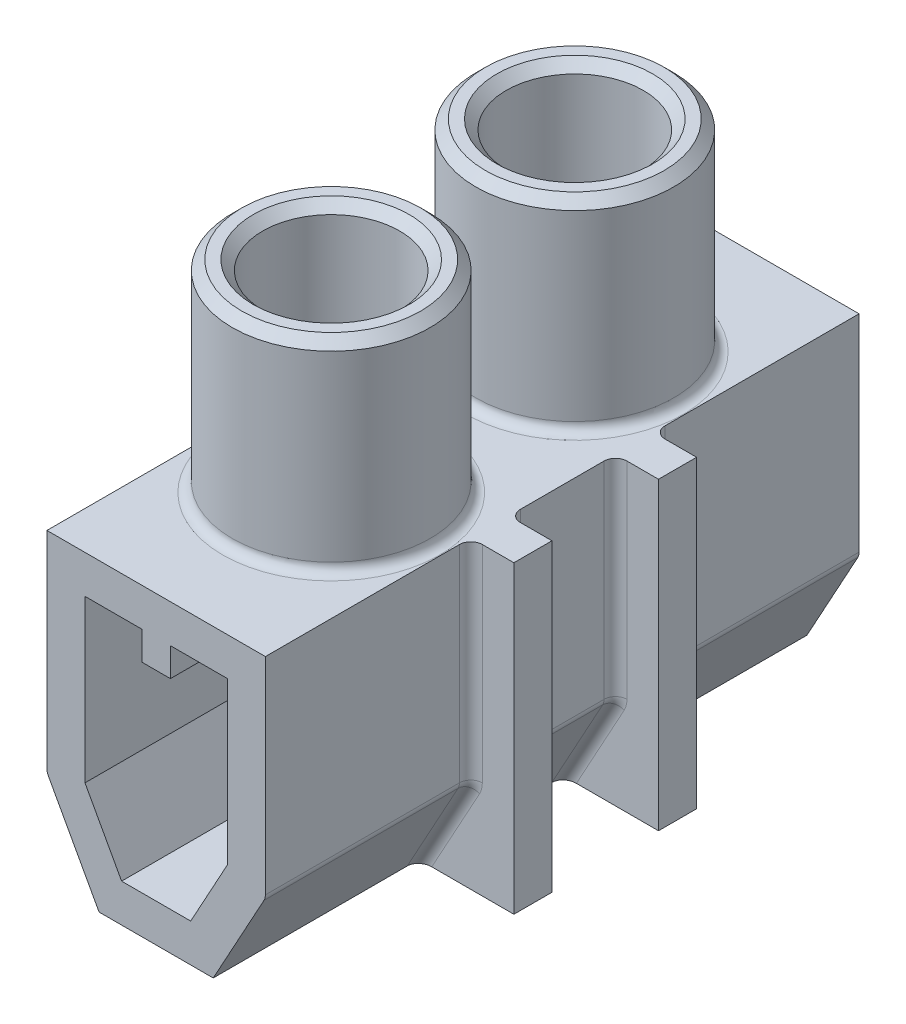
ISO-10303-21;
HEADER;
FILE_DESCRIPTION(('STEP AP214'),'2;1');
FILE_NAME('part.step','',(''),(''),'','','');
FILE_SCHEMA(('AUTOMOTIVE_DESIGN { 1 0 10303 214 1 1 1 1 }'));
ENDSEC;
DATA;
#1=APPLICATION_CONTEXT('core data for automotive mechanical design processes');
#2=APPLICATION_PROTOCOL_DEFINITION('international standard','automotive_design',2000,#1);
#3=PRODUCT_CONTEXT('',#1,'mechanical');
#4=PRODUCT('Part','Part','',(#3));
#5=PRODUCT_RELATED_PRODUCT_CATEGORY('part','',(#4));
#6=PRODUCT_DEFINITION_FORMATION('','',#4);
#7=PRODUCT_DEFINITION_CONTEXT('part definition',#1,'design');
#8=PRODUCT_DEFINITION('design','',#6,#7);
#9=PRODUCT_DEFINITION_SHAPE('','',#8);
#10=(LENGTH_UNIT() NAMED_UNIT(*) SI_UNIT(.MILLI.,.METRE.));
#11=(NAMED_UNIT(*) PLANE_ANGLE_UNIT() SI_UNIT($,.RADIAN.));
#12=(NAMED_UNIT(*) SI_UNIT($,.STERADIAN.) SOLID_ANGLE_UNIT());
#13=UNCERTAINTY_MEASURE_WITH_UNIT(LENGTH_MEASURE(1.E-05),#10,'distance_accuracy_value','');
#14=(GEOMETRIC_REPRESENTATION_CONTEXT(3) GLOBAL_UNCERTAINTY_ASSIGNED_CONTEXT((#13)) GLOBAL_UNIT_ASSIGNED_CONTEXT((#10,
#11,#12)) REPRESENTATION_CONTEXT('',''));
#15=CARTESIAN_POINT('',(0.,0.,0.));
#16=DIRECTION('',(0.,0.,1.));
#17=DIRECTION('',(1.,0.,0.));
#18=AXIS2_PLACEMENT_3D('',#15,#16,#17);
#19=CARTESIAN_POINT('',(2.87,-1.,7.8));
#20=DIRECTION('',(0.876955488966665,-0.480571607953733,0.));
#21=DIRECTION('',(0.480571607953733,0.876955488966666,0.));
#22=AXIS2_PLACEMENT_3D('',#19,#20,#21);
#23=PLANE('',#22);
#24=DIRECTION('',(0.,0.,-1.));
#25=VECTOR('',#24,1.);
#26=CARTESIAN_POINT('',(1.5,-3.5,7.8));
#27=LINE('',#26,#25);
#28=CARTESIAN_POINT('',(1.5,-3.5,1.1));
#29=VERTEX_POINT('',#28);
#30=CARTESIAN_POINT('',(1.5,-3.5,-1.1));
#31=VERTEX_POINT('',#30);
#32=EDGE_CURVE('E853',#29,#31,#27,.T.);
#33=ORIENTED_EDGE('',*,*,#32,.T.);
#34=DIRECTION('',(-0.480571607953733,-0.876955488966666,0.));
#35=VECTOR('',#34,1.);
#36=CARTESIAN_POINT('',(1.5,-3.5,-1.1));
#37=LINE('',#36,#35);
#38=CARTESIAN_POINT('',(2.83308664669,-1.06736013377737,-1.1));
#39=VERTEX_POINT('',#38);
#40=EDGE_CURVE('E632',#39,#31,#37,.T.);
#41=ORIENTED_EDGE('',*,*,#40,.F.);
#42=DIRECTION('',(0.,0.,-1.));
#43=VECTOR('',#42,1.);
#44=CARTESIAN_POINT('',(2.83308664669,-1.06736013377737,7.8));
#45=LINE('',#44,#43);
#46=CARTESIAN_POINT('',(2.83308664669,-1.06736013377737,1.1));
#47=VERTEX_POINT('',#46);
#48=EDGE_CURVE('E881',#39,#47,#45,.F.);
#49=ORIENTED_EDGE('',*,*,#48,.T.);
#50=DIRECTION('',(-0.480571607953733,-0.876955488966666,0.));
#51=VECTOR('',#50,1.);
#52=CARTESIAN_POINT('',(1.5,-3.5,1.1));
#53=LINE('',#52,#51);
#54=EDGE_CURVE('E879',#47,#29,#53,.T.);
#55=ORIENTED_EDGE('',*,*,#54,.T.);
#56=EDGE_LOOP('',(#33,#41,#49,#55));
#57=FACE_BOUND('',#56,.T.);
#58=ADVANCED_FACE('F47',(#57),#23,.T.);
#59=CARTESIAN_POINT('',(2.87,4.5,7.8));
#60=DIRECTION('',(1.,0.,0.));
#61=DIRECTION('',(0.,1.,0.));
#62=AXIS2_PLACEMENT_3D('',#59,#60,#61);
#63=PLANE('',#62);
#64=DIRECTION('',(0.,-1.,0.));
#65=VECTOR('',#64,1.);
#66=CARTESIAN_POINT('',(2.87,-1.,1.1));
#67=LINE('',#66,#65);
#68=CARTESIAN_POINT('',(2.87,4.5,1.1));
#69=VERTEX_POINT('',#68);
#70=CARTESIAN_POINT('',(2.87,-0.923188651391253,1.1));
#71=VERTEX_POINT('',#70);
#72=EDGE_CURVE('E875',#69,#71,#67,.T.);
#73=ORIENTED_EDGE('',*,*,#72,.T.);
#74=DIRECTION('',(0.,0.,-1.));
#75=VECTOR('',#74,1.);
#76=CARTESIAN_POINT('',(2.87,-0.923188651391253,7.8));
#77=LINE('',#76,#75);
#78=CARTESIAN_POINT('',(2.87,-0.923188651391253,-1.1));
#79=VERTEX_POINT('',#78);
#80=EDGE_CURVE('E877',#71,#79,#77,.T.);
#81=ORIENTED_EDGE('',*,*,#80,.T.);
#82=DIRECTION('',(0.,-1.,0.));
#83=VECTOR('',#82,1.);
#84=CARTESIAN_POINT('',(2.87,-1.,-1.1));
#85=LINE('',#84,#83);
#86=CARTESIAN_POINT('',(2.87,4.5,-1.1));
#87=VERTEX_POINT('',#86);
#88=EDGE_CURVE('E629',#87,#79,#85,.T.);
#89=ORIENTED_EDGE('',*,*,#88,.F.);
#90=DIRECTION('',(0.,0.,-1.));
#91=VECTOR('',#90,1.);
#92=CARTESIAN_POINT('',(2.87,4.5,7.8));
#93=LINE('',#92,#91);
#94=EDGE_CURVE('E849',#69,#87,#93,.T.);
#95=ORIENTED_EDGE('',*,*,#94,.F.);
#96=EDGE_LOOP('',(#73,#81,#89,#95));
#97=FACE_BOUND('',#96,.T.);
#98=ADVANCED_FACE('F971',(#97),#63,.T.);
#99=CARTESIAN_POINT('',(1.5,-2.5,7.8));
#100=DIRECTION('',(0.,-1.,0.));
#101=DIRECTION('',(1.,0.,0.));
#102=AXIS2_PLACEMENT_3D('',#99,#100,#101);
#103=PLANE('',#102);
#104=DIRECTION('',(0.,0.,-1.));
#105=VECTOR('',#104,1.);
#106=CARTESIAN_POINT('',(0.907691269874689,-2.5,7.8));
#107=LINE('',#106,#105);
#108=CARTESIAN_POINT('',(0.907691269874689,-2.5,7.8));
#109=VERTEX_POINT('',#108);
#110=CARTESIAN_POINT('',(0.907691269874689,-2.5,-7.8));
#111=VERTEX_POINT('',#110);
#112=EDGE_CURVE('E843',#109,#111,#107,.T.);
#113=ORIENTED_EDGE('',*,*,#112,.T.);
#114=DIRECTION('',(-1.,0.,0.));
#115=VECTOR('',#114,1.);
#116=CARTESIAN_POINT('',(1.5,-2.5,-7.8));
#117=LINE('',#116,#115);
#118=CARTESIAN_POINT('',(-0.907691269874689,-2.5,-7.8));
#119=VERTEX_POINT('',#118);
#120=EDGE_CURVE('E565',#111,#119,#117,.T.);
#121=ORIENTED_EDGE('',*,*,#120,.T.);
#122=DIRECTION('',(0.,0.,-1.));
#123=VECTOR('',#122,1.);
#124=CARTESIAN_POINT('',(-0.907691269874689,-2.5,7.8));
#125=LINE('',#124,#123);
#126=CARTESIAN_POINT('',(-0.907691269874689,-2.5,7.8));
#127=VERTEX_POINT('',#126);
#128=EDGE_CURVE('E725',#127,#119,#125,.T.);
#129=ORIENTED_EDGE('',*,*,#128,.F.);
#130=DIRECTION('',(-1.,0.,0.));
#131=VECTOR('',#130,1.);
#132=CARTESIAN_POINT('',(1.5,-2.5,7.8));
#133=LINE('',#132,#131);
#134=EDGE_CURVE('E815',#109,#127,#133,.T.);
#135=ORIENTED_EDGE('',*,*,#134,.F.);
#136=EDGE_LOOP('',(#113,#121,#129,#135));
#137=FACE_BOUND('',#136,.T.);
#138=ADVANCED_FACE('F979',(#137),#103,.F.);
#139=CARTESIAN_POINT('',(1.5,-3.5,7.8));
#140=DIRECTION('',(0.,-1.,0.));
#141=DIRECTION('',(1.,0.,0.));
#142=AXIS2_PLACEMENT_3D('',#139,#140,#141);
#143=PLANE('',#142);
#144=DIRECTION('',(0.,0.,-1.));
#145=VECTOR('',#144,1.);
#146=CARTESIAN_POINT('',(-1.5,-3.5,7.8));
#147=LINE('',#146,#145);
#148=CARTESIAN_POINT('',(-1.5,-3.5,1.1));
#149=VERTEX_POINT('',#148);
#150=CARTESIAN_POINT('',(-1.5,-3.5,-1.1));
#151=VERTEX_POINT('',#150);
#152=EDGE_CURVE('E735',#149,#151,#147,.T.);
#153=ORIENTED_EDGE('',*,*,#152,.T.);
#154=CARTESIAN_POINT('',(-1.84209261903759,-3.5,-1.1));
#155=DIRECTION('',(0.,-1.,0.));
#156=DIRECTION('',(-1.,0.,0.));
#157=AXIS2_PLACEMENT_3D('',#154,#155,#156);
#158=ELLIPSE('',#157,0.342092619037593,0.3);
#159=CARTESIAN_POINT('',(-1.84209261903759,-3.5,-1.4));
#160=VERTEX_POINT('',#159);
#161=EDGE_CURVE('E536',#151,#160,#158,.F.);
#162=ORIENTED_EDGE('',*,*,#161,.T.);
#163=DIRECTION('',(-1.,0.,0.));
#164=VECTOR('',#163,1.);
#165=CARTESIAN_POINT('',(0.00200000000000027,-3.5,-1.4));
#166=LINE('',#165,#164);
#167=CARTESIAN_POINT('',(-4.,-3.5,-1.4));
#168=VERTEX_POINT('',#167);
#169=EDGE_CURVE('E470',#160,#168,#166,.T.);
#170=ORIENTED_EDGE('',*,*,#169,.T.);
#171=DIRECTION('',(0.,0.,1.));
#172=VECTOR('',#171,1.);
#173=CARTESIAN_POINT('',(-4.,-3.5,-2.4));
#174=LINE('',#173,#172);
#175=CARTESIAN_POINT('',(-4.,-3.5,-2.4));
#176=VERTEX_POINT('',#175);
#177=EDGE_CURVE('E457',#176,#168,#174,.T.);
#178=ORIENTED_EDGE('',*,*,#177,.F.);
#179=DIRECTION('',(-1.,0.,0.));
#180=VECTOR('',#179,1.);
#181=CARTESIAN_POINT('',(0.00200000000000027,-3.5,-2.4));
#182=LINE('',#181,#180);
#183=CARTESIAN_POINT('',(-1.84209261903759,-3.5,-2.4));
#184=VERTEX_POINT('',#183);
#185=EDGE_CURVE('E467',#184,#176,#182,.T.);
#186=ORIENTED_EDGE('',*,*,#185,.F.);
#187=CARTESIAN_POINT('',(-1.84209261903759,-3.5,-2.7));
#188=DIRECTION('',(0.,-1.,0.));
#189=DIRECTION('',(1.,0.,0.));
#190=AXIS2_PLACEMENT_3D('',#187,#188,#189);
#191=ELLIPSE('',#190,0.342092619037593,0.3);
#192=CARTESIAN_POINT('',(-1.5,-3.5,-2.7));
#193=VERTEX_POINT('',#192);
#194=EDGE_CURVE('E530',#184,#193,#191,.F.);
#195=ORIENTED_EDGE('',*,*,#194,.T.);
#196=DIRECTION('',(0.,0.,1.));
#197=VECTOR('',#196,1.);
#198=CARTESIAN_POINT('',(-1.5,-3.5,-7.8));
#199=LINE('',#198,#197);
#200=CARTESIAN_POINT('',(-1.5,-3.5,-7.8));
#201=VERTEX_POINT('',#200);
#202=EDGE_CURVE('E492',#201,#193,#199,.T.);
#203=ORIENTED_EDGE('',*,*,#202,.F.);
#204=DIRECTION('',(-1.,0.,0.));
#205=VECTOR('',#204,1.);
#206=CARTESIAN_POINT('',(1.5,-3.5,-7.8));
#207=LINE('',#206,#205);
#208=CARTESIAN_POINT('',(1.5,-3.5,-7.8));
#209=VERTEX_POINT('',#208);
#210=EDGE_CURVE('E582',#209,#201,#207,.T.);
#211=ORIENTED_EDGE('',*,*,#210,.F.);
#212=DIRECTION('',(0.,0.,1.));
#213=VECTOR('',#212,1.);
#214=CARTESIAN_POINT('',(1.5,-3.5,-7.8));
#215=LINE('',#214,#213);
#216=CARTESIAN_POINT('',(1.5,-3.5,-2.7));
#217=VERTEX_POINT('',#216);
#218=EDGE_CURVE('E604',#209,#217,#215,.T.);
#219=ORIENTED_EDGE('',*,*,#218,.T.);
#220=CARTESIAN_POINT('',(1.84209261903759,-3.5,-2.7));
#221=DIRECTION('',(0.,1.,0.));
#222=DIRECTION('',(-1.,0.,0.));
#223=AXIS2_PLACEMENT_3D('',#220,#221,#222);
#224=ELLIPSE('',#223,0.342092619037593,0.3);
#225=CARTESIAN_POINT('',(1.84209261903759,-3.5,-2.4));
#226=VERTEX_POINT('',#225);
#227=EDGE_CURVE('E643',#226,#217,#224,.F.);
#228=ORIENTED_EDGE('',*,*,#227,.F.);
#229=DIRECTION('',(1.,0.,0.));
#230=VECTOR('',#229,1.);
#231=CARTESIAN_POINT('',(-0.00200000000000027,-3.5,-2.4));
#232=LINE('',#231,#230);
#233=CARTESIAN_POINT('',(4.,-3.5,-2.4));
#234=VERTEX_POINT('',#233);
#235=EDGE_CURVE('E568',#226,#234,#232,.T.);
#236=ORIENTED_EDGE('',*,*,#235,.T.);
#237=DIRECTION('',(0.,0.,1.));
#238=VECTOR('',#237,1.);
#239=CARTESIAN_POINT('',(4.,-3.5,-2.4));
#240=LINE('',#239,#238);
#241=CARTESIAN_POINT('',(4.,-3.5,-1.4));
#242=VERTEX_POINT('',#241);
#243=EDGE_CURVE('E558',#234,#242,#240,.T.);
#244=ORIENTED_EDGE('',*,*,#243,.T.);
#245=DIRECTION('',(1.,0.,0.));
#246=VECTOR('',#245,1.);
#247=CARTESIAN_POINT('',(-0.00200000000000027,-3.5,-1.4));
#248=LINE('',#247,#246);
#249=CARTESIAN_POINT('',(1.84209261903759,-3.5,-1.4));
#250=VERTEX_POINT('',#249);
#251=EDGE_CURVE('E571',#250,#242,#248,.T.);
#252=ORIENTED_EDGE('',*,*,#251,.F.);
#253=CARTESIAN_POINT('',(1.84209261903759,-3.5,-1.1));
#254=DIRECTION('',(0.,1.,0.));
#255=DIRECTION('',(1.,0.,0.));
#256=AXIS2_PLACEMENT_3D('',#253,#254,#255);
#257=ELLIPSE('',#256,0.342092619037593,0.3);
#258=EDGE_CURVE('E649',#31,#250,#257,.F.);
#259=ORIENTED_EDGE('',*,*,#258,.F.);
#260=ORIENTED_EDGE('',*,*,#32,.F.);
#261=CARTESIAN_POINT('',(1.84209261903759,-3.5,1.1));
#262=DIRECTION('',(0.,-1.,0.));
#263=DIRECTION('',(1.,0.,0.));
#264=AXIS2_PLACEMENT_3D('',#261,#262,#263);
#265=ELLIPSE('',#264,0.342092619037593,0.3);
#266=CARTESIAN_POINT('',(1.84209261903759,-3.5,1.4));
#267=VERTEX_POINT('',#266);
#268=EDGE_CURVE('E893',#29,#267,#265,.F.);
#269=ORIENTED_EDGE('',*,*,#268,.T.);
#270=DIRECTION('',(1.,0.,0.));
#271=VECTOR('',#270,1.);
#272=CARTESIAN_POINT('',(-0.00200000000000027,-3.5,1.4));
#273=LINE('',#272,#271);
#274=CARTESIAN_POINT('',(4.,-3.5,1.4));
#275=VERTEX_POINT('',#274);
#276=EDGE_CURVE('E820',#267,#275,#273,.T.);
#277=ORIENTED_EDGE('',*,*,#276,.T.);
#278=DIRECTION('',(0.,0.,-1.));
#279=VECTOR('',#278,1.);
#280=CARTESIAN_POINT('',(4.,-3.5,2.4));
#281=LINE('',#280,#279);
#282=CARTESIAN_POINT('',(4.,-3.5,2.4));
#283=VERTEX_POINT('',#282);
#284=EDGE_CURVE('E807',#283,#275,#281,.T.);
#285=ORIENTED_EDGE('',*,*,#284,.F.);
#286=DIRECTION('',(1.,0.,0.));
#287=VECTOR('',#286,1.);
#288=CARTESIAN_POINT('',(-0.00200000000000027,-3.5,2.4));
#289=LINE('',#288,#287);
#290=CARTESIAN_POINT('',(1.84209261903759,-3.5,2.4));
#291=VERTEX_POINT('',#290);
#292=EDGE_CURVE('E818',#291,#283,#289,.T.);
#293=ORIENTED_EDGE('',*,*,#292,.F.);
#294=CARTESIAN_POINT('',(1.84209261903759,-3.5,2.7));
#295=DIRECTION('',(0.,-1.,0.));
#296=DIRECTION('',(-1.,0.,0.));
#297=AXIS2_PLACEMENT_3D('',#294,#295,#296);
#298=ELLIPSE('',#297,0.342092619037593,0.3);
#299=CARTESIAN_POINT('',(1.5,-3.5,2.7));
#300=VERTEX_POINT('',#299);
#301=EDGE_CURVE('E889',#291,#300,#298,.F.);
#302=ORIENTED_EDGE('',*,*,#301,.T.);
#303=CARTESIAN_POINT('',(1.5,-3.5,7.8));
#304=VERTEX_POINT('',#303);
#305=EDGE_CURVE('E854',#304,#300,#27,.T.);
#306=ORIENTED_EDGE('',*,*,#305,.F.);
#307=DIRECTION('',(-1.,0.,0.));
#308=VECTOR('',#307,1.);
#309=CARTESIAN_POINT('',(1.5,-3.5,7.8));
#310=LINE('',#309,#308);
#311=CARTESIAN_POINT('',(-1.5,-3.5,7.8));
#312=VERTEX_POINT('',#311);
#313=EDGE_CURVE('E827',#304,#312,#310,.T.);
#314=ORIENTED_EDGE('',*,*,#313,.T.);
#315=CARTESIAN_POINT('',(-1.5,-3.5,2.7));
#316=VERTEX_POINT('',#315);
#317=EDGE_CURVE('E736',#312,#316,#147,.T.);
#318=ORIENTED_EDGE('',*,*,#317,.T.);
#319=CARTESIAN_POINT('',(-1.84209261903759,-3.5,2.7));
#320=DIRECTION('',(0.,1.,0.));
#321=DIRECTION('',(1.,0.,0.));
#322=AXIS2_PLACEMENT_3D('',#319,#320,#321);
#323=ELLIPSE('',#322,0.342092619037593,0.3);
#324=CARTESIAN_POINT('',(-1.84209261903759,-3.5,2.4));
#325=VERTEX_POINT('',#324);
#326=EDGE_CURVE('E780',#325,#316,#323,.F.);
#327=ORIENTED_EDGE('',*,*,#326,.F.);
#328=DIRECTION('',(-1.,0.,0.));
#329=VECTOR('',#328,1.);
#330=CARTESIAN_POINT('',(0.00200000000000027,-3.5,2.4));
#331=LINE('',#330,#329);
#332=CARTESIAN_POINT('',(-4.,-3.5,2.4));
#333=VERTEX_POINT('',#332);
#334=EDGE_CURVE('E702',#325,#333,#331,.T.);
#335=ORIENTED_EDGE('',*,*,#334,.T.);
#336=DIRECTION('',(0.,0.,-1.));
#337=VECTOR('',#336,1.);
#338=CARTESIAN_POINT('',(-4.,-3.5,2.4));
#339=LINE('',#338,#337);
#340=CARTESIAN_POINT('',(-4.,-3.5,1.4));
#341=VERTEX_POINT('',#340);
#342=EDGE_CURVE('E692',#333,#341,#339,.T.);
#343=ORIENTED_EDGE('',*,*,#342,.T.);
#344=DIRECTION('',(-1.,0.,0.));
#345=VECTOR('',#344,1.);
#346=CARTESIAN_POINT('',(0.00200000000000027,-3.5,1.4));
#347=LINE('',#346,#345);
#348=CARTESIAN_POINT('',(-1.84209261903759,-3.5,1.4));
#349=VERTEX_POINT('',#348);
#350=EDGE_CURVE('E705',#349,#341,#347,.T.);
#351=ORIENTED_EDGE('',*,*,#350,.F.);
#352=CARTESIAN_POINT('',(-1.84209261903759,-3.5,1.1));
#353=DIRECTION('',(0.,1.,0.));
#354=DIRECTION('',(-1.,0.,0.));
#355=AXIS2_PLACEMENT_3D('',#352,#353,#354);
#356=ELLIPSE('',#355,0.342092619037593,0.3);
#357=EDGE_CURVE('E786',#149,#349,#356,.F.);
#358=ORIENTED_EDGE('',*,*,#357,.F.);
#359=EDGE_LOOP('',(#153,#162,#170,#178,#186,#195,#203,#211,#219,#228,#236,#244,#252,#259,#260,
#269,#277,#285,#293,#302,#306,#314,#318,#327,#335,#343,#351,#358));
#360=FACE_BOUND('',#359,.T.);
#361=ADVANCED_FACE('F985',(#360),#143,.T.);
#362=DIRECTION('',(0.480571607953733,0.876955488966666,0.));
#363=VECTOR('',#362,1.);
#364=CARTESIAN_POINT('',(2.87,-1.,2.7));
#365=LINE('',#364,#363);
#366=CARTESIAN_POINT('',(2.83308664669,-1.06736013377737,2.7));
#367=VERTEX_POINT('',#366);
#368=EDGE_CURVE('E862',#300,#367,#365,.T.);
#369=ORIENTED_EDGE('',*,*,#368,.T.);
#370=DIRECTION('',(0.,0.,-1.));
#371=VECTOR('',#370,1.);
#372=CARTESIAN_POINT('',(2.83308664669,-1.06736013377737,7.8));
#373=LINE('',#372,#371);
#374=CARTESIAN_POINT('',(2.83308664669,-1.06736013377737,7.8));
#375=VERTEX_POINT('',#374);
#376=EDGE_CURVE('E864',#367,#375,#373,.F.);
#377=ORIENTED_EDGE('',*,*,#376,.T.);
#378=DIRECTION('',(-0.480571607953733,-0.876955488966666,0.));
#379=VECTOR('',#378,1.);
#380=CARTESIAN_POINT('',(2.87,-1.,7.8));
#381=LINE('',#380,#379);
#382=EDGE_CURVE('E829',#375,#304,#381,.T.);
#383=ORIENTED_EDGE('',*,*,#382,.T.);
#384=ORIENTED_EDGE('',*,*,#305,.T.);
#385=EDGE_LOOP('',(#369,#377,#383,#384));
#386=FACE_BOUND('',#385,.T.);
#387=ADVANCED_FACE('F974',(#386),#23,.T.);
#388=DIRECTION('',(0.,-1.,0.));
#389=VECTOR('',#388,1.);
#390=CARTESIAN_POINT('',(2.87,4.5,7.8));
#391=LINE('',#390,#389);
#392=CARTESIAN_POINT('',(2.87,4.5,7.8));
#393=VERTEX_POINT('',#392);
#394=CARTESIAN_POINT('',(2.87,-0.923188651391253,7.8));
#395=VERTEX_POINT('',#394);
#396=EDGE_CURVE('E831',#393,#395,#391,.T.);
#397=ORIENTED_EDGE('',*,*,#396,.T.);
#398=DIRECTION('',(0.,0.,-1.));
#399=VECTOR('',#398,1.);
#400=CARTESIAN_POINT('',(2.87,-0.923188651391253,7.8));
#401=LINE('',#400,#399);
#402=CARTESIAN_POINT('',(2.87,-0.923188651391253,2.7));
#403=VERTEX_POINT('',#402);
#404=EDGE_CURVE('E859',#395,#403,#401,.T.);
#405=ORIENTED_EDGE('',*,*,#404,.T.);
#406=DIRECTION('',(0.,1.,0.));
#407=VECTOR('',#406,1.);
#408=CARTESIAN_POINT('',(2.87,4.5,2.7));
#409=LINE('',#408,#407);
#410=CARTESIAN_POINT('',(2.87,4.5,2.7));
#411=VERTEX_POINT('',#410);
#412=EDGE_CURVE('E857',#403,#411,#409,.T.);
#413=ORIENTED_EDGE('',*,*,#412,.T.);
#414=EDGE_CURVE('E850',#393,#411,#93,.T.);
#415=ORIENTED_EDGE('',*,*,#414,.F.);
#416=EDGE_LOOP('',(#397,#405,#413,#415));
#417=FACE_BOUND('',#416,.T.);
#418=ADVANCED_FACE('F982',(#417),#63,.T.);
#419=CARTESIAN_POINT('',(0.,4.5,7.8));
#420=DIRECTION('',(0.,1.,0.));
#421=DIRECTION('',(0.,0.,1.));
#422=AXIS2_PLACEMENT_3D('',#419,#420,#421);
#423=PLANE('',#422);
#424=CARTESIAN_POINT('',(0.,4.5,3.2));
#425=DIRECTION('',(0.,1.,0.));
#426=DIRECTION('',(0.,0.,1.));
#427=AXIS2_PLACEMENT_3D('',#424,#425,#426);
#428=CIRCLE('',#427,2.85);
#429=CARTESIAN_POINT('',(0.,4.5,6.05));
#430=VERTEX_POINT('',#429);
#431=EDGE_CURVE('E915',#430,#430,#428,.F.);
#432=ORIENTED_EDGE('',*,*,#431,.T.);
#433=EDGE_LOOP('',(#432));
#434=FACE_BOUND('',#433,.T.);
#435=ORIENTED_EDGE('',*,*,#94,.T.);
#436=CARTESIAN_POINT('',(3.17,4.5,-1.1));
#437=DIRECTION('',(0.,-1.,0.));
#438=DIRECTION('',(0.,0.,-1.));
#439=AXIS2_PLACEMENT_3D('',#436,#437,#438);
#440=CIRCLE('',#439,0.3);
#441=CARTESIAN_POINT('',(3.17,4.5,-1.4));
#442=VERTEX_POINT('',#441);
#443=EDGE_CURVE('E652',#442,#87,#440,.F.);
#444=ORIENTED_EDGE('',*,*,#443,.F.);
#445=DIRECTION('',(1.,0.,0.));
#446=VECTOR('',#445,1.);
#447=CARTESIAN_POINT('',(-0.00200000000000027,4.5,-1.4));
#448=LINE('',#447,#446);
#449=CARTESIAN_POINT('',(4.,4.5,-1.4));
#450=VERTEX_POINT('',#449);
#451=EDGE_CURVE('E575',#442,#450,#448,.T.);
#452=ORIENTED_EDGE('',*,*,#451,.T.);
#453=DIRECTION('',(0.,0.,-1.));
#454=VECTOR('',#453,1.);
#455=CARTESIAN_POINT('',(4.,4.5,-2.4));
#456=LINE('',#455,#454);
#457=CARTESIAN_POINT('',(4.,4.5,-2.4));
#458=VERTEX_POINT('',#457);
#459=EDGE_CURVE('E559',#450,#458,#456,.T.);
#460=ORIENTED_EDGE('',*,*,#459,.T.);
#461=DIRECTION('',(1.,0.,0.));
#462=VECTOR('',#461,1.);
#463=CARTESIAN_POINT('',(-0.00200000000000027,4.5,-2.4));
#464=LINE('',#463,#462);
#465=CARTESIAN_POINT('',(3.17,4.5,-2.4));
#466=VERTEX_POINT('',#465);
#467=EDGE_CURVE('E562',#466,#458,#464,.T.);
#468=ORIENTED_EDGE('',*,*,#467,.F.);
#469=CARTESIAN_POINT('',(3.17,4.5,-2.7));
#470=DIRECTION('',(0.,-1.,0.));
#471=DIRECTION('',(0.,0.,-1.));
#472=AXIS2_PLACEMENT_3D('',#469,#470,#471);
#473=CIRCLE('',#472,0.3);
#474=CARTESIAN_POINT('',(2.87,4.5,-2.7));
#475=VERTEX_POINT('',#474);
#476=EDGE_CURVE('E646',#475,#466,#473,.F.);
#477=ORIENTED_EDGE('',*,*,#476,.F.);
#478=DIRECTION('',(0.,0.,1.));
#479=VECTOR('',#478,1.);
#480=CARTESIAN_POINT('',(2.87,4.5,-7.8));
#481=LINE('',#480,#479);
#482=CARTESIAN_POINT('',(2.87,4.5,-7.8));
#483=VERTEX_POINT('',#482);
#484=EDGE_CURVE('E601',#483,#475,#481,.T.);
#485=ORIENTED_EDGE('',*,*,#484,.F.);
#486=DIRECTION('',(1.,0.,0.));
#487=VECTOR('',#486,1.);
#488=CARTESIAN_POINT('',(0.,4.5,-7.8));
#489=LINE('',#488,#487);
#490=CARTESIAN_POINT('',(-2.87,4.5,-7.8));
#491=VERTEX_POINT('',#490);
#492=EDGE_CURVE('E590',#491,#483,#489,.T.);
#493=ORIENTED_EDGE('',*,*,#492,.F.);
#494=DIRECTION('',(0.,0.,1.));
#495=VECTOR('',#494,1.);
#496=CARTESIAN_POINT('',(-2.87,4.5,-7.8));
#497=LINE('',#496,#495);
#498=CARTESIAN_POINT('',(-2.87,4.5,-2.7));
#499=VERTEX_POINT('',#498);
#500=EDGE_CURVE('E489',#491,#499,#497,.T.);
#501=ORIENTED_EDGE('',*,*,#500,.T.);
#502=CARTESIAN_POINT('',(-3.17,4.5,-2.7));
#503=DIRECTION('',(0.,1.,0.));
#504=DIRECTION('',(0.,0.,-1.));
#505=AXIS2_PLACEMENT_3D('',#502,#503,#504);
#506=CIRCLE('',#505,0.3);
#507=CARTESIAN_POINT('',(-3.17,4.5,-2.4));
#508=VERTEX_POINT('',#507);
#509=EDGE_CURVE('E533',#499,#508,#506,.F.);
#510=ORIENTED_EDGE('',*,*,#509,.T.);
#511=DIRECTION('',(-1.,0.,0.));
#512=VECTOR('',#511,1.);
#513=CARTESIAN_POINT('',(0.00200000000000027,4.5,-2.4));
#514=LINE('',#513,#512);
#515=CARTESIAN_POINT('',(-4.,4.5,-2.4));
#516=VERTEX_POINT('',#515);
#517=EDGE_CURVE('E461',#508,#516,#514,.T.);
#518=ORIENTED_EDGE('',*,*,#517,.T.);
#519=DIRECTION('',(0.,0.,-1.));
#520=VECTOR('',#519,1.);
#521=CARTESIAN_POINT('',(-4.,4.5,-2.4));
#522=LINE('',#521,#520);
#523=CARTESIAN_POINT('',(-4.,4.5,-1.4));
#524=VERTEX_POINT('',#523);
#525=EDGE_CURVE('E458',#524,#516,#522,.T.);
#526=ORIENTED_EDGE('',*,*,#525,.F.);
#527=DIRECTION('',(-1.,0.,0.));
#528=VECTOR('',#527,1.);
#529=CARTESIAN_POINT('',(0.00200000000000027,4.5,-1.4));
#530=LINE('',#529,#528);
#531=CARTESIAN_POINT('',(-3.17,4.5,-1.4));
#532=VERTEX_POINT('',#531);
#533=EDGE_CURVE('E474',#532,#524,#530,.T.);
#534=ORIENTED_EDGE('',*,*,#533,.F.);
#535=CARTESIAN_POINT('',(-3.17,4.5,-1.1));
#536=DIRECTION('',(0.,1.,0.));
#537=DIRECTION('',(0.,0.,-1.));
#538=AXIS2_PLACEMENT_3D('',#535,#536,#537);
#539=CIRCLE('',#538,0.3);
#540=CARTESIAN_POINT('',(-2.87,4.5,-1.1));
#541=VERTEX_POINT('',#540);
#542=EDGE_CURVE('E539',#532,#541,#539,.F.);
#543=ORIENTED_EDGE('',*,*,#542,.T.);
#544=DIRECTION('',(0.,0.,-1.));
#545=VECTOR('',#544,1.);
#546=CARTESIAN_POINT('',(-2.87,4.5,7.8));
#547=LINE('',#546,#545);
#548=CARTESIAN_POINT('',(-2.87,4.5,1.1));
#549=VERTEX_POINT('',#548);
#550=EDGE_CURVE('E731',#549,#541,#547,.T.);
#551=ORIENTED_EDGE('',*,*,#550,.F.);
#552=CARTESIAN_POINT('',(-3.17,4.5,1.1));
#553=DIRECTION('',(0.,-1.,0.));
#554=DIRECTION('',(0.,0.,1.));
#555=AXIS2_PLACEMENT_3D('',#552,#553,#554);
#556=CIRCLE('',#555,0.3);
#557=CARTESIAN_POINT('',(-3.17,4.5,1.4));
#558=VERTEX_POINT('',#557);
#559=EDGE_CURVE('E789',#558,#549,#556,.F.);
#560=ORIENTED_EDGE('',*,*,#559,.F.);
#561=DIRECTION('',(-1.,0.,0.));
#562=VECTOR('',#561,1.);
#563=CARTESIAN_POINT('',(0.00200000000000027,4.5,1.4));
#564=LINE('',#563,#562);
#565=CARTESIAN_POINT('',(-4.,4.5,1.4));
#566=VERTEX_POINT('',#565);
#567=EDGE_CURVE('E709',#558,#566,#564,.T.);
#568=ORIENTED_EDGE('',*,*,#567,.T.);
#569=DIRECTION('',(0.,0.,1.));
#570=VECTOR('',#569,1.);
#571=CARTESIAN_POINT('',(-4.,4.5,2.4));
#572=LINE('',#571,#570);
#573=CARTESIAN_POINT('',(-4.,4.5,2.4));
#574=VERTEX_POINT('',#573);
#575=EDGE_CURVE('E693',#566,#574,#572,.T.);
#576=ORIENTED_EDGE('',*,*,#575,.T.);
#577=DIRECTION('',(-1.,0.,0.));
#578=VECTOR('',#577,1.);
#579=CARTESIAN_POINT('',(0.00200000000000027,4.5,2.4));
#580=LINE('',#579,#578);
#581=CARTESIAN_POINT('',(-3.17,4.5,2.4));
#582=VERTEX_POINT('',#581);
#583=EDGE_CURVE('E696',#582,#574,#580,.T.);
#584=ORIENTED_EDGE('',*,*,#583,.F.);
#585=CARTESIAN_POINT('',(-3.17,4.5,2.7));
#586=DIRECTION('',(0.,-1.,0.));
#587=DIRECTION('',(0.,0.,1.));
#588=AXIS2_PLACEMENT_3D('',#585,#586,#587);
#589=CIRCLE('',#588,0.3);
#590=CARTESIAN_POINT('',(-2.87,4.5,2.7));
#591=VERTEX_POINT('',#590);
#592=EDGE_CURVE('E783',#591,#582,#589,.F.);
#593=ORIENTED_EDGE('',*,*,#592,.F.);
#594=CARTESIAN_POINT('',(-2.87,4.5,7.8));
#595=VERTEX_POINT('',#594);
#596=EDGE_CURVE('E732',#595,#591,#547,.T.);
#597=ORIENTED_EDGE('',*,*,#596,.F.);
#598=DIRECTION('',(1.,0.,0.));
#599=VECTOR('',#598,1.);
#600=CARTESIAN_POINT('',(0.,4.5,7.8));
#601=LINE('',#600,#599);
#602=EDGE_CURVE('E834',#595,#393,#601,.T.);
#603=ORIENTED_EDGE('',*,*,#602,.T.);
#604=ORIENTED_EDGE('',*,*,#414,.T.);
#605=CARTESIAN_POINT('',(3.17,4.5,2.7));
#606=DIRECTION('',(0.,1.,0.));
#607=DIRECTION('',(0.,0.,1.));
#608=AXIS2_PLACEMENT_3D('',#605,#606,#607);
#609=CIRCLE('',#608,0.3);
#610=CARTESIAN_POINT('',(3.17,4.5,2.4));
#611=VERTEX_POINT('',#610);
#612=EDGE_CURVE('E891',#411,#611,#609,.F.);
#613=ORIENTED_EDGE('',*,*,#612,.T.);
#614=DIRECTION('',(1.,0.,0.));
#615=VECTOR('',#614,1.);
#616=CARTESIAN_POINT('',(-0.00200000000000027,4.5,2.4));
#617=LINE('',#616,#615);
#618=CARTESIAN_POINT('',(4.,4.5,2.4));
#619=VERTEX_POINT('',#618);
#620=EDGE_CURVE('E811',#611,#619,#617,.T.);
#621=ORIENTED_EDGE('',*,*,#620,.T.);
#622=DIRECTION('',(0.,0.,1.));
#623=VECTOR('',#622,1.);
#624=CARTESIAN_POINT('',(4.,4.5,2.4));
#625=LINE('',#624,#623);
#626=CARTESIAN_POINT('',(4.,4.5,1.4));
#627=VERTEX_POINT('',#626);
#628=EDGE_CURVE('E808',#627,#619,#625,.T.);
#629=ORIENTED_EDGE('',*,*,#628,.F.);
#630=DIRECTION('',(1.,0.,0.));
#631=VECTOR('',#630,1.);
#632=CARTESIAN_POINT('',(-0.00200000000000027,4.5,1.4));
#633=LINE('',#632,#631);
#634=CARTESIAN_POINT('',(3.17,4.5,1.4));
#635=VERTEX_POINT('',#634);
#636=EDGE_CURVE('E823',#635,#627,#633,.T.);
#637=ORIENTED_EDGE('',*,*,#636,.F.);
#638=CARTESIAN_POINT('',(3.17,4.5,1.1));
#639=DIRECTION('',(0.,1.,0.));
#640=DIRECTION('',(0.,0.,1.));
#641=AXIS2_PLACEMENT_3D('',#638,#639,#640);
#642=CIRCLE('',#641,0.3);
#643=EDGE_CURVE('E895',#635,#69,#642,.F.);
#644=ORIENTED_EDGE('',*,*,#643,.T.);
#645=EDGE_LOOP('',(#435,#444,#452,#460,#468,#477,#485,#493,#501,#510,#518,#526,#534,#543,#551,
#560,#568,#576,#584,#593,#597,#603,#604,#613,#621,#629,#637,#644));
#646=FACE_BOUND('',#645,.T.);
#647=CARTESIAN_POINT('',(0.,4.5,-3.2));
#648=DIRECTION('',(0.,-1.,0.));
#649=DIRECTION('',(0.,0.,-1.));
#650=AXIS2_PLACEMENT_3D('',#647,#648,#649);
#651=CIRCLE('',#650,2.85);
#652=CARTESIAN_POINT('',(0.,4.5,-6.05));
#653=VERTEX_POINT('',#652);
#654=EDGE_CURVE('E671',#653,#653,#651,.F.);
#655=ORIENTED_EDGE('',*,*,#654,.F.);
#656=EDGE_LOOP('',(#655));
#657=FACE_BOUND('',#656,.T.);
#658=ADVANCED_FACE('F946',(#434,#646,#657),#423,.T.);
#659=CARTESIAN_POINT('',(0.,3.5,7.8));
#660=DIRECTION('',(0.,1.,0.));
#661=DIRECTION('',(0.,0.,1.));
#662=AXIS2_PLACEMENT_3D('',#659,#660,#661);
#663=PLANE('',#662);
#664=DIRECTION('',(1.,0.,0.));
#665=VECTOR('',#664,1.);
#666=CARTESIAN_POINT('',(0.,3.5,7.8));
#667=LINE('',#666,#665);
#668=CARTESIAN_POINT('',(0.375000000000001,3.5,7.8));
#669=VERTEX_POINT('',#668);
#670=CARTESIAN_POINT('',(1.87,3.5,7.8));
#671=VERTEX_POINT('',#670);
#672=EDGE_CURVE('E837',#669,#671,#667,.T.);
#673=ORIENTED_EDGE('',*,*,#672,.F.);
#674=DIRECTION('',(0.,0.,1.));
#675=VECTOR('',#674,1.);
#676=CARTESIAN_POINT('',(0.375000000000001,3.5,4.23933982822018));
#677=LINE('',#676,#675);
#678=CARTESIAN_POINT('',(0.375000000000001,3.5,5.3));
#679=VERTEX_POINT('',#678);
#680=EDGE_CURVE('E443',#679,#669,#677,.T.);
#681=ORIENTED_EDGE('',*,*,#680,.F.);
#682=DIRECTION('',(-1.,0.,0.));
#683=VECTOR('',#682,1.);
#684=CARTESIAN_POINT('',(-0.374999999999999,3.5,5.3));
#685=LINE('',#684,#683);
#686=CARTESIAN_POINT('',(-0.374999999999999,3.5,5.3));
#687=VERTEX_POINT('',#686);
#688=EDGE_CURVE('E448',#679,#687,#685,.T.);
#689=ORIENTED_EDGE('',*,*,#688,.T.);
#690=DIRECTION('',(0.,0.,1.));
#691=VECTOR('',#690,1.);
#692=CARTESIAN_POINT('',(-0.374999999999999,3.5,4.23933982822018));
#693=LINE('',#692,#691);
#694=CARTESIAN_POINT('',(-0.374999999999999,3.5,7.8));
#695=VERTEX_POINT('',#694);
#696=EDGE_CURVE('E440',#687,#695,#693,.T.);
#697=ORIENTED_EDGE('',*,*,#696,.T.);
#698=CARTESIAN_POINT('',(-1.87,3.5,7.8));
#699=VERTEX_POINT('',#698);
#700=EDGE_CURVE('E434',#699,#695,#667,.T.);
#701=ORIENTED_EDGE('',*,*,#700,.F.);
#702=DIRECTION('',(0.,0.,-1.));
#703=VECTOR('',#702,1.);
#704=CARTESIAN_POINT('',(-1.87,3.5,7.8));
#705=LINE('',#704,#703);
#706=CARTESIAN_POINT('',(-1.87,3.5,-7.8));
#707=VERTEX_POINT('',#706);
#708=EDGE_CURVE('E729',#699,#707,#705,.T.);
#709=ORIENTED_EDGE('',*,*,#708,.T.);
#710=DIRECTION('',(1.,0.,0.));
#711=VECTOR('',#710,1.);
#712=CARTESIAN_POINT('',(0.,3.5,-7.8));
#713=LINE('',#712,#711);
#714=CARTESIAN_POINT('',(1.87,3.5,-7.8));
#715=VERTEX_POINT('',#714);
#716=EDGE_CURVE('E592',#707,#715,#713,.T.);
#717=ORIENTED_EDGE('',*,*,#716,.T.);
#718=DIRECTION('',(0.,0.,-1.));
#719=VECTOR('',#718,1.);
#720=CARTESIAN_POINT('',(1.87,3.5,7.8));
#721=LINE('',#720,#719);
#722=EDGE_CURVE('E847',#671,#715,#721,.T.);
#723=ORIENTED_EDGE('',*,*,#722,.F.);
#724=EDGE_LOOP('',(#673,#681,#689,#697,#701,#709,#717,#723));
#725=FACE_BOUND('',#724,.T.);
#726=CARTESIAN_POINT('',(0.,3.5,3.2));
#727=DIRECTION('',(0.,1.,0.));
#728=DIRECTION('',(0.,0.,1.));
#729=AXIS2_PLACEMENT_3D('',#726,#727,#728);
#730=CIRCLE('',#729,1.8);
#731=CARTESIAN_POINT('',(0.,3.5,5.));
#732=VERTEX_POINT('',#731);
#733=EDGE_CURVE('E686',#732,#732,#730,.F.);
#734=ORIENTED_EDGE('',*,*,#733,.F.);
#735=EDGE_LOOP('',(#734));
#736=FACE_BOUND('',#735,.T.);
#737=CARTESIAN_POINT('',(0.,3.5,-3.2));
#738=DIRECTION('',(0.,-1.,0.));
#739=DIRECTION('',(0.,0.,-1.));
#740=AXIS2_PLACEMENT_3D('',#737,#738,#739);
#741=CIRCLE('',#740,1.8);
#742=CARTESIAN_POINT('',(0.,3.5,-5.));
#743=VERTEX_POINT('',#742);
#744=EDGE_CURVE('E451',#743,#743,#741,.F.);
#745=ORIENTED_EDGE('',*,*,#744,.T.);
#746=EDGE_LOOP('',(#745));
#747=FACE_BOUND('',#746,.T.);
#748=ADVANCED_FACE('F942',(#725,#736,#747),#663,.F.);
#749=CARTESIAN_POINT('',(1.87,4.5,7.8));
#750=DIRECTION('',(1.,0.,0.));
#751=DIRECTION('',(0.,1.,0.));
#752=AXIS2_PLACEMENT_3D('',#749,#750,#751);
#753=PLANE('',#752);
#754=ORIENTED_EDGE('',*,*,#722,.T.);
#755=DIRECTION('',(0.,-1.,0.));
#756=VECTOR('',#755,1.);
#757=CARTESIAN_POINT('',(1.87,4.5,-7.8));
#758=LINE('',#757,#756);
#759=CARTESIAN_POINT('',(1.87,-0.743962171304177,-7.8));
#760=VERTEX_POINT('',#759);
#761=EDGE_CURVE('E595',#715,#760,#758,.T.);
#762=ORIENTED_EDGE('',*,*,#761,.T.);
#763=DIRECTION('',(0.,0.,-1.));
#764=VECTOR('',#763,1.);
#765=CARTESIAN_POINT('',(1.87,-0.743962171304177,7.8));
#766=LINE('',#765,#764);
#767=CARTESIAN_POINT('',(1.87,-0.743962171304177,7.8));
#768=VERTEX_POINT('',#767);
#769=EDGE_CURVE('E845',#768,#760,#766,.T.);
#770=ORIENTED_EDGE('',*,*,#769,.F.);
#771=DIRECTION('',(0.,-1.,0.));
#772=VECTOR('',#771,1.);
#773=CARTESIAN_POINT('',(1.87,4.5,7.8));
#774=LINE('',#773,#772);
#775=EDGE_CURVE('E839',#671,#768,#774,.T.);
#776=ORIENTED_EDGE('',*,*,#775,.F.);
#777=EDGE_LOOP('',(#754,#762,#770,#776));
#778=FACE_BOUND('',#777,.T.);
#779=ADVANCED_FACE('F945',(#778),#753,.F.);
#780=CARTESIAN_POINT('',(1.99304451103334,-0.519428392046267,7.8));
#781=DIRECTION('',(0.876955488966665,-0.480571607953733,0.));
#782=DIRECTION('',(0.480571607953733,0.876955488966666,0.));
#783=AXIS2_PLACEMENT_3D('',#780,#781,#782);
#784=PLANE('',#783);
#785=ORIENTED_EDGE('',*,*,#769,.T.);
#786=DIRECTION('',(-0.480571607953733,-0.876955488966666,0.));
#787=VECTOR('',#786,1.);
#788=CARTESIAN_POINT('',(1.99304451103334,-0.519428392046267,-7.8));
#789=LINE('',#788,#787);
#790=EDGE_CURVE('E598',#760,#111,#789,.T.);
#791=ORIENTED_EDGE('',*,*,#790,.T.);
#792=ORIENTED_EDGE('',*,*,#112,.F.);
#793=DIRECTION('',(-0.480571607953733,-0.876955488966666,0.));
#794=VECTOR('',#793,1.);
#795=CARTESIAN_POINT('',(1.99304451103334,-0.519428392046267,7.8));
#796=LINE('',#795,#794);
#797=EDGE_CURVE('E841',#768,#109,#796,.T.);
#798=ORIENTED_EDGE('',*,*,#797,.F.);
#799=EDGE_LOOP('',(#785,#791,#792,#798));
#800=FACE_BOUND('',#799,.T.);
#801=ADVANCED_FACE('F1263',(#800),#784,.F.);
#802=CARTESIAN_POINT('',(0.,0.,7.8));
#803=DIRECTION('',(0.,0.,-1.));
#804=DIRECTION('',(-1.,0.,0.));
#805=AXIS2_PLACEMENT_3D('',#802,#803,#804);
#806=PLANE('',#805);
#807=ORIENTED_EDGE('',*,*,#134,.T.);
#808=DIRECTION('',(0.480571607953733,-0.876955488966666,0.));
#809=VECTOR('',#808,1.);
#810=CARTESIAN_POINT('',(-1.99304451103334,-0.519428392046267,7.8));
#811=LINE('',#810,#809);
#812=CARTESIAN_POINT('',(-1.87,-0.743962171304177,7.8));
#813=VERTEX_POINT('',#812);
#814=EDGE_CURVE('E722',#813,#127,#811,.T.);
#815=ORIENTED_EDGE('',*,*,#814,.F.);
#816=DIRECTION('',(0.,-1.,0.));
#817=VECTOR('',#816,1.);
#818=CARTESIAN_POINT('',(-1.87,4.5,7.8));
#819=LINE('',#818,#817);
#820=EDGE_CURVE('E719',#699,#813,#819,.T.);
#821=ORIENTED_EDGE('',*,*,#820,.F.);
#822=ORIENTED_EDGE('',*,*,#700,.T.);
#823=DIRECTION('',(0.,-1.,0.));
#824=VECTOR('',#823,1.);
#825=CARTESIAN_POINT('',(-0.374999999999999,3.5,7.8));
#826=LINE('',#825,#824);
#827=CARTESIAN_POINT('',(-0.374999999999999,2.75,7.8));
#828=VERTEX_POINT('',#827);
#829=EDGE_CURVE('E419',#695,#828,#826,.T.);
#830=ORIENTED_EDGE('',*,*,#829,.T.);
#831=DIRECTION('',(1.,0.,0.));
#832=VECTOR('',#831,1.);
#833=CARTESIAN_POINT('',(-0.374999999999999,2.75,7.8));
#834=LINE('',#833,#832);
#835=CARTESIAN_POINT('',(0.375000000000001,2.75,7.8));
#836=VERTEX_POINT('',#835);
#837=EDGE_CURVE('E426',#828,#836,#834,.T.);
#838=ORIENTED_EDGE('',*,*,#837,.T.);
#839=DIRECTION('',(0.,1.,0.));
#840=VECTOR('',#839,1.);
#841=CARTESIAN_POINT('',(0.375000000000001,3.5,7.8));
#842=LINE('',#841,#840);
#843=EDGE_CURVE('E62',#836,#669,#842,.T.);
#844=ORIENTED_EDGE('',*,*,#843,.T.);
#845=ORIENTED_EDGE('',*,*,#672,.T.);
#846=ORIENTED_EDGE('',*,*,#775,.T.);
#847=ORIENTED_EDGE('',*,*,#797,.T.);
#848=EDGE_LOOP('',(#807,#815,#821,#822,#830,#838,#844,#845,#846,#847));
#849=FACE_BOUND('',#848,.T.);
#850=ORIENTED_EDGE('',*,*,#382,.F.);
#851=CARTESIAN_POINT('',(2.57,-0.923188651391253,7.8));
#852=DIRECTION('',(0.,0.,-1.));
#853=DIRECTION('',(-1.,0.,0.));
#854=AXIS2_PLACEMENT_3D('',#851,#852,#853);
#855=CIRCLE('',#854,0.3);
#856=EDGE_CURVE('E866',#375,#395,#855,.F.);
#857=ORIENTED_EDGE('',*,*,#856,.T.);
#858=ORIENTED_EDGE('',*,*,#396,.F.);
#859=ORIENTED_EDGE('',*,*,#602,.F.);
#860=DIRECTION('',(0.,-1.,0.));
#861=VECTOR('',#860,1.);
#862=CARTESIAN_POINT('',(-2.87,4.5,7.8));
#863=LINE('',#862,#861);
#864=CARTESIAN_POINT('',(-2.87,-0.923188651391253,7.8));
#865=VERTEX_POINT('',#864);
#866=EDGE_CURVE('E716',#595,#865,#863,.T.);
#867=ORIENTED_EDGE('',*,*,#866,.T.);
#868=CARTESIAN_POINT('',(-2.57,-0.923188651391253,7.8));
#869=DIRECTION('',(0.,0.,1.));
#870=DIRECTION('',(1.,0.,0.));
#871=AXIS2_PLACEMENT_3D('',#868,#869,#870);
#872=CIRCLE('',#871,0.3);
#873=CARTESIAN_POINT('',(-2.83308664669,-1.06736013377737,7.8));
#874=VERTEX_POINT('',#873);
#875=EDGE_CURVE('E751',#874,#865,#872,.F.);
#876=ORIENTED_EDGE('',*,*,#875,.F.);
#877=DIRECTION('',(0.480571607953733,-0.876955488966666,0.));
#878=VECTOR('',#877,1.);
#879=CARTESIAN_POINT('',(-2.87,-1.,7.8));
#880=LINE('',#879,#878);
#881=EDGE_CURVE('E699',#874,#312,#880,.T.);
#882=ORIENTED_EDGE('',*,*,#881,.T.);
#883=ORIENTED_EDGE('',*,*,#313,.F.);
#884=EDGE_LOOP('',(#850,#857,#858,#859,#867,#876,#882,#883));
#885=FACE_BOUND('',#884,.T.);
#886=ADVANCED_FACE('F431',(#849,#885),#806,.F.);
#887=CARTESIAN_POINT('',(-0.00200000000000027,4.5,1.4));
#888=DIRECTION('',(0.,0.,-1.));
#889=DIRECTION('',(-1.,0.,0.));
#890=AXIS2_PLACEMENT_3D('',#887,#888,#889);
#891=PLANE('',#890);
#892=ORIENTED_EDGE('',*,*,#276,.F.);
#893=DIRECTION('',(-0.480571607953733,-0.876955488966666,0.));
#894=VECTOR('',#893,1.);
#895=CARTESIAN_POINT('',(3.13308664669,-1.14417148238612,1.4));
#896=LINE('',#895,#894);
#897=CARTESIAN_POINT('',(3.09617329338,-1.21153161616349,1.4));
#898=VERTEX_POINT('',#897);
#899=EDGE_CURVE('E70',#267,#898,#896,.F.);
#900=ORIENTED_EDGE('',*,*,#899,.T.);
#901=CARTESIAN_POINT('',(2.57,-0.923188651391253,1.4));
#902=DIRECTION('',(0.,0.,-1.));
#903=DIRECTION('',(-1.,0.,0.));
#904=AXIS2_PLACEMENT_3D('',#901,#902,#903);
#905=CIRCLE('',#904,0.6);
#906=CARTESIAN_POINT('',(3.17,-0.923188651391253,1.4));
#907=VERTEX_POINT('',#906);
#908=EDGE_CURVE('E885',#907,#898,#905,.T.);
#909=ORIENTED_EDGE('',*,*,#908,.F.);
#910=DIRECTION('',(0.,-1.,0.));
#911=VECTOR('',#910,1.);
#912=CARTESIAN_POINT('',(3.17,4.5,1.4));
#913=LINE('',#912,#911);
#914=EDGE_CURVE('E883',#907,#635,#913,.F.);
#915=ORIENTED_EDGE('',*,*,#914,.T.);
#916=ORIENTED_EDGE('',*,*,#636,.T.);
#917=DIRECTION('',(0.,1.,0.));
#918=VECTOR('',#917,1.);
#919=CARTESIAN_POINT('',(4.,4.5,1.4));
#920=LINE('',#919,#918);
#921=EDGE_CURVE('E804',#275,#627,#920,.T.);
#922=ORIENTED_EDGE('',*,*,#921,.F.);
#923=EDGE_LOOP('',(#892,#900,#909,#915,#916,#922));
#924=FACE_BOUND('',#923,.T.);
#925=ADVANCED_FACE('F1047',(#924),#891,.T.);
#926=CARTESIAN_POINT('',(4.,0.,0.));
#927=DIRECTION('',(1.,0.,0.));
#928=DIRECTION('',(0.,0.,-1.));
#929=AXIS2_PLACEMENT_3D('',#926,#927,#928);
#930=PLANE('',#929);
#931=DIRECTION('',(0.,-1.,0.));
#932=VECTOR('',#931,1.);
#933=CARTESIAN_POINT('',(4.,4.5,2.4));
#934=LINE('',#933,#932);
#935=EDGE_CURVE('E812',#619,#283,#934,.T.);
#936=ORIENTED_EDGE('',*,*,#935,.T.);
#937=ORIENTED_EDGE('',*,*,#284,.T.);
#938=ORIENTED_EDGE('',*,*,#921,.T.);
#939=ORIENTED_EDGE('',*,*,#628,.T.);
#940=EDGE_LOOP('',(#936,#937,#938,#939));
#941=FACE_BOUND('',#940,.T.);
#942=ADVANCED_FACE('F1045',(#941),#930,.T.);
#943=CARTESIAN_POINT('',(-0.00200000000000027,4.5,2.4));
#944=DIRECTION('',(0.,0.,1.));
#945=DIRECTION('',(0.,-1.,0.));
#946=AXIS2_PLACEMENT_3D('',#943,#944,#945);
#947=PLANE('',#946);
#948=CARTESIAN_POINT('',(2.57,-0.923188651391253,2.4));
#949=DIRECTION('',(0.,0.,1.));
#950=DIRECTION('',(0.,-1.,0.));
#951=AXIS2_PLACEMENT_3D('',#948,#949,#950);
#952=CIRCLE('',#951,0.6);
#953=CARTESIAN_POINT('',(3.09617329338,-1.21153161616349,2.4));
#954=VERTEX_POINT('',#953);
#955=CARTESIAN_POINT('',(3.17,-0.923188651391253,2.4));
#956=VERTEX_POINT('',#955);
#957=EDGE_CURVE('E868',#954,#956,#952,.T.);
#958=ORIENTED_EDGE('',*,*,#957,.F.);
#959=DIRECTION('',(0.480571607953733,0.876955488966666,0.));
#960=VECTOR('',#959,1.);
#961=CARTESIAN_POINT('',(1.76308664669,-3.64417148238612,2.4));
#962=LINE('',#961,#960);
#963=EDGE_CURVE('E873',#954,#291,#962,.F.);
#964=ORIENTED_EDGE('',*,*,#963,.T.);
#965=ORIENTED_EDGE('',*,*,#292,.T.);
#966=ORIENTED_EDGE('',*,*,#935,.F.);
#967=ORIENTED_EDGE('',*,*,#620,.F.);
#968=DIRECTION('',(0.,1.,0.));
#969=VECTOR('',#968,1.);
#970=CARTESIAN_POINT('',(3.17,-1.,2.4));
#971=LINE('',#970,#969);
#972=EDGE_CURVE('E871',#611,#956,#971,.F.);
#973=ORIENTED_EDGE('',*,*,#972,.T.);
#974=EDGE_LOOP('',(#958,#964,#965,#966,#967,#973));
#975=FACE_BOUND('',#974,.T.);
#976=ADVANCED_FACE('F1040',(#975),#947,.T.);
#977=CARTESIAN_POINT('',(3.17,4.5,2.7));
#978=DIRECTION('',(0.,-1.,0.));
#979=DIRECTION('',(1.,0.,0.));
#980=AXIS2_PLACEMENT_3D('',#977,#978,#979);
#981=CYLINDRICAL_SURFACE('',#980,0.3);
#982=ORIENTED_EDGE('',*,*,#612,.F.);
#983=ORIENTED_EDGE('',*,*,#412,.F.);
#984=CARTESIAN_POINT('',(3.17,-0.923188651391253,2.7));
#985=DIRECTION('',(0.,1.,0.));
#986=DIRECTION('',(0.,0.,1.));
#987=AXIS2_PLACEMENT_3D('',#984,#985,#986);
#988=CIRCLE('',#987,0.3);
#989=EDGE_CURVE('E821',#956,#403,#988,.T.);
#990=ORIENTED_EDGE('',*,*,#989,.F.);
#991=ORIENTED_EDGE('',*,*,#972,.F.);
#992=EDGE_LOOP('',(#982,#983,#990,#991));
#993=FACE_BOUND('',#992,.T.);
#994=ADVANCED_FACE('F1015',(#993),#981,.F.);
#995=CARTESIAN_POINT('',(3.13308664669,-1.14417148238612,2.7));
#996=DIRECTION('',(-0.480571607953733,-0.876955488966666,0.));
#997=DIRECTION('',(0.876955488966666,-0.480571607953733,0.));
#998=AXIS2_PLACEMENT_3D('',#995,#996,#997);
#999=CYLINDRICAL_SURFACE('',#998,0.3);
#1000=ORIENTED_EDGE('',*,*,#301,.F.);
#1001=ORIENTED_EDGE('',*,*,#963,.F.);
#1002=CARTESIAN_POINT('',(3.09617329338,-1.21153161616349,2.7));
#1003=DIRECTION('',(-0.480571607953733,-0.876955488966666,0.));
#1004=DIRECTION('',(0.876955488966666,-0.480571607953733,0.));
#1005=AXIS2_PLACEMENT_3D('',#1002,#1003,#1004);
#1006=CIRCLE('',#1005,0.3);
#1007=EDGE_CURVE('E900',#367,#954,#1006,.T.);
#1008=ORIENTED_EDGE('',*,*,#1007,.F.);
#1009=ORIENTED_EDGE('',*,*,#368,.F.);
#1010=EDGE_LOOP('',(#1000,#1001,#1008,#1009));
#1011=FACE_BOUND('',#1010,.T.);
#1012=ADVANCED_FACE('F1002',(#1011),#999,.F.);
#1013=CARTESIAN_POINT('',(2.57,-0.923188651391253,2.7));
#1014=DIRECTION('',(0.,0.,1.));
#1015=DIRECTION('',(0.,-1.,0.));
#1016=AXIS2_PLACEMENT_3D('',#1013,#1014,#1015);
#1017=TOROIDAL_SURFACE('',#1016,0.6,0.3);
#1018=ORIENTED_EDGE('',*,*,#957,.T.);
#1019=ORIENTED_EDGE('',*,*,#989,.T.);
#1020=CARTESIAN_POINT('',(2.57,-0.923188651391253,2.7));
#1021=DIRECTION('',(0.,0.,1.));
#1022=DIRECTION('',(0.,-1.,0.));
#1023=AXIS2_PLACEMENT_3D('',#1020,#1021,#1022);
#1024=CIRCLE('',#1023,0.3);
#1025=EDGE_CURVE('E898',#367,#403,#1024,.T.);
#1026=ORIENTED_EDGE('',*,*,#1025,.F.);
#1027=ORIENTED_EDGE('',*,*,#1007,.T.);
#1028=EDGE_LOOP('',(#1018,#1019,#1026,#1027));
#1029=FACE_BOUND('',#1028,.T.);
#1030=ADVANCED_FACE('F1009',(#1029),#1017,.F.);
#1031=CARTESIAN_POINT('',(2.57,-0.923188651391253,7.8));
#1032=DIRECTION('',(0.,0.,-1.));
#1033=DIRECTION('',(-1.,0.,0.));
#1034=AXIS2_PLACEMENT_3D('',#1031,#1032,#1033);
#1035=CYLINDRICAL_SURFACE('',#1034,0.3);
#1036=ORIENTED_EDGE('',*,*,#856,.F.);
#1037=ORIENTED_EDGE('',*,*,#376,.F.);
#1038=ORIENTED_EDGE('',*,*,#1025,.T.);
#1039=ORIENTED_EDGE('',*,*,#404,.F.);
#1040=EDGE_LOOP('',(#1036,#1037,#1038,#1039));
#1041=FACE_BOUND('',#1040,.T.);
#1042=ADVANCED_FACE('F1007',(#1041),#1035,.T.);
#1043=CARTESIAN_POINT('',(3.13308664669,-1.14417148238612,1.1));
#1044=DIRECTION('',(0.480571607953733,0.876955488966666,0.));
#1045=DIRECTION('',(-0.876955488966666,0.480571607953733,0.));
#1046=AXIS2_PLACEMENT_3D('',#1043,#1044,#1045);
#1047=CYLINDRICAL_SURFACE('',#1046,0.3);
#1048=ORIENTED_EDGE('',*,*,#268,.F.);
#1049=ORIENTED_EDGE('',*,*,#54,.F.);
#1050=CARTESIAN_POINT('',(3.09617329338,-1.21153161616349,1.1));
#1051=DIRECTION('',(-0.480571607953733,-0.876955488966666,0.));
#1052=DIRECTION('',(0.876955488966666,-0.480571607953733,0.));
#1053=AXIS2_PLACEMENT_3D('',#1050,#1051,#1052);
#1054=CIRCLE('',#1053,0.3);
#1055=EDGE_CURVE('E901',#898,#47,#1054,.T.);
#1056=ORIENTED_EDGE('',*,*,#1055,.F.);
#1057=ORIENTED_EDGE('',*,*,#899,.F.);
#1058=EDGE_LOOP('',(#1048,#1049,#1056,#1057));
#1059=FACE_BOUND('',#1058,.T.);
#1060=ADVANCED_FACE('F1186',(#1059),#1047,.F.);
#1061=CARTESIAN_POINT('',(3.17,4.5,1.1));
#1062=DIRECTION('',(0.,1.,0.));
#1063=DIRECTION('',(-1.,0.,0.));
#1064=AXIS2_PLACEMENT_3D('',#1061,#1062,#1063);
#1065=CYLINDRICAL_SURFACE('',#1064,0.3);
#1066=ORIENTED_EDGE('',*,*,#643,.F.);
#1067=ORIENTED_EDGE('',*,*,#914,.F.);
#1068=CARTESIAN_POINT('',(3.17,-0.923188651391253,1.1));
#1069=DIRECTION('',(0.,1.,0.));
#1070=DIRECTION('',(0.,0.,1.));
#1071=AXIS2_PLACEMENT_3D('',#1068,#1069,#1070);
#1072=CIRCLE('',#1071,0.3);
#1073=EDGE_CURVE('E908',#71,#907,#1072,.T.);
#1074=ORIENTED_EDGE('',*,*,#1073,.F.);
#1075=ORIENTED_EDGE('',*,*,#72,.F.);
#1076=EDGE_LOOP('',(#1066,#1067,#1074,#1075));
#1077=FACE_BOUND('',#1076,.T.);
#1078=ADVANCED_FACE('F1053',(#1077),#1065,.F.);
#1079=CARTESIAN_POINT('',(2.57,-0.923188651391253,1.1));
#1080=DIRECTION('',(0.,0.,-1.));
#1081=DIRECTION('',(-1.,0.,0.));
#1082=AXIS2_PLACEMENT_3D('',#1079,#1080,#1081);
#1083=TOROIDAL_SURFACE('',#1082,0.6,0.3);
#1084=ORIENTED_EDGE('',*,*,#908,.T.);
#1085=ORIENTED_EDGE('',*,*,#1055,.T.);
#1086=CARTESIAN_POINT('',(2.57,-0.923188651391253,1.1));
#1087=DIRECTION('',(0.,0.,-1.));
#1088=DIRECTION('',(-1.,0.,0.));
#1089=AXIS2_PLACEMENT_3D('',#1086,#1087,#1088);
#1090=CIRCLE('',#1089,0.3);
#1091=EDGE_CURVE('E791',#71,#47,#1090,.T.);
#1092=ORIENTED_EDGE('',*,*,#1091,.F.);
#1093=ORIENTED_EDGE('',*,*,#1073,.T.);
#1094=EDGE_LOOP('',(#1084,#1085,#1092,#1093));
#1095=FACE_BOUND('',#1094,.T.);
#1096=ADVANCED_FACE('F1188',(#1095),#1083,.F.);
#1097=CARTESIAN_POINT('',(2.57,-0.923188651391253,7.8));
#1098=DIRECTION('',(0.,0.,-1.));
#1099=DIRECTION('',(-1.,0.,0.));
#1100=AXIS2_PLACEMENT_3D('',#1097,#1098,#1099);
#1101=CYLINDRICAL_SURFACE('',#1100,0.3);
#1102=ORIENTED_EDGE('',*,*,#1091,.T.);
#1103=ORIENTED_EDGE('',*,*,#48,.F.);
#1104=CARTESIAN_POINT('',(2.57,-0.923188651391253,-1.1));
#1105=DIRECTION('',(0.,0.,-1.));
#1106=DIRECTION('',(-1.,0.,0.));
#1107=AXIS2_PLACEMENT_3D('',#1104,#1105,#1106);
#1108=CIRCLE('',#1107,0.3);
#1109=EDGE_CURVE('E542',#79,#39,#1108,.T.);
#1110=ORIENTED_EDGE('',*,*,#1109,.F.);
#1111=ORIENTED_EDGE('',*,*,#80,.F.);
#1112=EDGE_LOOP('',(#1102,#1103,#1110,#1111));
#1113=FACE_BOUND('',#1112,.T.);
#1114=ADVANCED_FACE('F1190',(#1113),#1101,.T.);
#1115=CARTESIAN_POINT('',(-2.87,-1.,7.8));
#1116=DIRECTION('',(-0.876955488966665,-0.480571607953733,0.));
#1117=DIRECTION('',(-0.480571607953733,0.876955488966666,0.));
#1118=AXIS2_PLACEMENT_3D('',#1115,#1116,#1117);
#1119=PLANE('',#1118);
#1120=DIRECTION('',(0.,0.,-1.));
#1121=VECTOR('',#1120,1.);
#1122=CARTESIAN_POINT('',(-2.83308664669,-1.06736013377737,7.8));
#1123=LINE('',#1122,#1121);
#1124=CARTESIAN_POINT('',(-2.83308664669,-1.06736013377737,-1.1));
#1125=VERTEX_POINT('',#1124);
#1126=CARTESIAN_POINT('',(-2.83308664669,-1.06736013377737,1.1));
#1127=VERTEX_POINT('',#1126);
#1128=EDGE_CURVE('E769',#1125,#1127,#1123,.F.);
#1129=ORIENTED_EDGE('',*,*,#1128,.F.);
#1130=DIRECTION('',(0.480571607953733,-0.876955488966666,0.));
#1131=VECTOR('',#1130,1.);
#1132=CARTESIAN_POINT('',(-1.5,-3.5,-1.1));
#1133=LINE('',#1132,#1131);
#1134=EDGE_CURVE('E519',#1125,#151,#1133,.T.);
#1135=ORIENTED_EDGE('',*,*,#1134,.T.);
#1136=ORIENTED_EDGE('',*,*,#152,.F.);
#1137=DIRECTION('',(0.480571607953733,-0.876955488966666,0.));
#1138=VECTOR('',#1137,1.);
#1139=CARTESIAN_POINT('',(-1.5,-3.5,1.1));
#1140=LINE('',#1139,#1138);
#1141=EDGE_CURVE('E766',#1127,#149,#1140,.T.);
#1142=ORIENTED_EDGE('',*,*,#1141,.F.);
#1143=EDGE_LOOP('',(#1129,#1135,#1136,#1142));
#1144=FACE_BOUND('',#1143,.T.);
#1145=ADVANCED_FACE('F1153',(#1144),#1119,.T.);
#1146=CARTESIAN_POINT('',(-2.87,4.5,7.8));
#1147=DIRECTION('',(-1.,0.,0.));
#1148=DIRECTION('',(0.,1.,0.));
#1149=AXIS2_PLACEMENT_3D('',#1146,#1147,#1148);
#1150=PLANE('',#1149);
#1151=DIRECTION('',(0.,-1.,0.));
#1152=VECTOR('',#1151,1.);
#1153=CARTESIAN_POINT('',(-2.87,-1.,1.1));
#1154=LINE('',#1153,#1152);
#1155=CARTESIAN_POINT('',(-2.87,-0.923188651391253,1.1));
#1156=VERTEX_POINT('',#1155);
#1157=EDGE_CURVE('E761',#549,#1156,#1154,.T.);
#1158=ORIENTED_EDGE('',*,*,#1157,.F.);
#1159=ORIENTED_EDGE('',*,*,#550,.T.);
#1160=DIRECTION('',(0.,-1.,0.));
#1161=VECTOR('',#1160,1.);
#1162=CARTESIAN_POINT('',(-2.87,-1.,-1.1));
#1163=LINE('',#1162,#1161);
#1164=CARTESIAN_POINT('',(-2.87,-0.923188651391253,-1.1));
#1165=VERTEX_POINT('',#1164);
#1166=EDGE_CURVE('E516',#541,#1165,#1163,.T.);
#1167=ORIENTED_EDGE('',*,*,#1166,.T.);
#1168=DIRECTION('',(0.,0.,-1.));
#1169=VECTOR('',#1168,1.);
#1170=CARTESIAN_POINT('',(-2.87,-0.923188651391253,7.8));
#1171=LINE('',#1170,#1169);
#1172=EDGE_CURVE('E764',#1156,#1165,#1171,.T.);
#1173=ORIENTED_EDGE('',*,*,#1172,.F.);
#1174=EDGE_LOOP('',(#1158,#1159,#1167,#1173));
#1175=FACE_BOUND('',#1174,.T.);
#1176=ADVANCED_FACE('F1122',(#1175),#1150,.T.);
#1177=DIRECTION('',(-0.480571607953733,0.876955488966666,0.));
#1178=VECTOR('',#1177,1.);
#1179=CARTESIAN_POINT('',(-2.87,-1.,2.7));
#1180=LINE('',#1179,#1178);
#1181=CARTESIAN_POINT('',(-2.83308664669,-1.06736013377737,2.7));
#1182=VERTEX_POINT('',#1181);
#1183=EDGE_CURVE('E745',#316,#1182,#1180,.T.);
#1184=ORIENTED_EDGE('',*,*,#1183,.F.);
#1185=ORIENTED_EDGE('',*,*,#317,.F.);
#1186=ORIENTED_EDGE('',*,*,#881,.F.);
#1187=DIRECTION('',(0.,0.,-1.));
#1188=VECTOR('',#1187,1.);
#1189=CARTESIAN_POINT('',(-2.83308664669,-1.06736013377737,7.8));
#1190=LINE('',#1189,#1188);
#1191=EDGE_CURVE('E748',#1182,#874,#1190,.F.);
#1192=ORIENTED_EDGE('',*,*,#1191,.F.);
#1193=EDGE_LOOP('',(#1184,#1185,#1186,#1192));
#1194=FACE_BOUND('',#1193,.T.);
#1195=ADVANCED_FACE('F1034',(#1194),#1119,.T.);
#1196=ORIENTED_EDGE('',*,*,#866,.F.);
#1197=ORIENTED_EDGE('',*,*,#596,.T.);
#1198=DIRECTION('',(0.,1.,0.));
#1199=VECTOR('',#1198,1.);
#1200=CARTESIAN_POINT('',(-2.87,4.5,2.7));
#1201=LINE('',#1200,#1199);
#1202=CARTESIAN_POINT('',(-2.87,-0.923188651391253,2.7));
#1203=VERTEX_POINT('',#1202);
#1204=EDGE_CURVE('E739',#1203,#591,#1201,.T.);
#1205=ORIENTED_EDGE('',*,*,#1204,.F.);
#1206=DIRECTION('',(0.,0.,-1.));
#1207=VECTOR('',#1206,1.);
#1208=CARTESIAN_POINT('',(-2.87,-0.923188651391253,7.8));
#1209=LINE('',#1208,#1207);
#1210=EDGE_CURVE('E742',#865,#1203,#1209,.T.);
#1211=ORIENTED_EDGE('',*,*,#1210,.F.);
#1212=EDGE_LOOP('',(#1196,#1197,#1205,#1211));
#1213=FACE_BOUND('',#1212,.T.);
#1214=ADVANCED_FACE('F1025',(#1213),#1150,.T.);
#1215=CARTESIAN_POINT('',(-1.87,4.5,7.8));
#1216=DIRECTION('',(-1.,0.,0.));
#1217=DIRECTION('',(0.,1.,0.));
#1218=AXIS2_PLACEMENT_3D('',#1215,#1216,#1217);
#1219=PLANE('',#1218);
#1220=DIRECTION('',(0.,0.,-1.));
#1221=VECTOR('',#1220,1.);
#1222=CARTESIAN_POINT('',(-1.87,-0.743962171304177,7.8));
#1223=LINE('',#1222,#1221);
#1224=CARTESIAN_POINT('',(-1.87,-0.743962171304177,-7.8));
#1225=VERTEX_POINT('',#1224);
#1226=EDGE_CURVE('E727',#813,#1225,#1223,.T.);
#1227=ORIENTED_EDGE('',*,*,#1226,.T.);
#1228=DIRECTION('',(0.,-1.,0.));
#1229=VECTOR('',#1228,1.);
#1230=CARTESIAN_POINT('',(-1.87,4.5,-7.8));
#1231=LINE('',#1230,#1229);
#1232=EDGE_CURVE('E483',#707,#1225,#1231,.T.);
#1233=ORIENTED_EDGE('',*,*,#1232,.F.);
#1234=ORIENTED_EDGE('',*,*,#708,.F.);
#1235=ORIENTED_EDGE('',*,*,#820,.T.);
#1236=EDGE_LOOP('',(#1227,#1233,#1234,#1235));
#1237=FACE_BOUND('',#1236,.T.);
#1238=ADVANCED_FACE('F1229',(#1237),#1219,.F.);
#1239=CARTESIAN_POINT('',(-1.99304451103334,-0.519428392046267,7.8));
#1240=DIRECTION('',(-0.876955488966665,-0.480571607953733,0.));
#1241=DIRECTION('',(-0.480571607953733,0.876955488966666,0.));
#1242=AXIS2_PLACEMENT_3D('',#1239,#1240,#1241);
#1243=PLANE('',#1242);
#1244=ORIENTED_EDGE('',*,*,#128,.T.);
#1245=DIRECTION('',(0.480571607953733,-0.876955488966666,0.));
#1246=VECTOR('',#1245,1.);
#1247=CARTESIAN_POINT('',(-1.99304451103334,-0.519428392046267,-7.8));
#1248=LINE('',#1247,#1246);
#1249=EDGE_CURVE('E486',#1225,#119,#1248,.T.);
#1250=ORIENTED_EDGE('',*,*,#1249,.F.);
#1251=ORIENTED_EDGE('',*,*,#1226,.F.);
#1252=ORIENTED_EDGE('',*,*,#814,.T.);
#1253=EDGE_LOOP('',(#1244,#1250,#1251,#1252));
#1254=FACE_BOUND('',#1253,.T.);
#1255=ADVANCED_FACE('F1224',(#1254),#1243,.F.);
#1256=CARTESIAN_POINT('',(0.00200000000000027,4.5,1.4));
#1257=DIRECTION('',(0.,0.,-1.));
#1258=DIRECTION('',(1.,0.,0.));
#1259=AXIS2_PLACEMENT_3D('',#1256,#1257,#1258);
#1260=PLANE('',#1259);
#1261=ORIENTED_EDGE('',*,*,#350,.T.);
#1262=DIRECTION('',(0.,1.,0.));
#1263=VECTOR('',#1262,1.);
#1264=CARTESIAN_POINT('',(-4.,4.5,1.4));
#1265=LINE('',#1264,#1263);
#1266=EDGE_CURVE('E690',#341,#566,#1265,.T.);
#1267=ORIENTED_EDGE('',*,*,#1266,.T.);
#1268=ORIENTED_EDGE('',*,*,#567,.F.);
#1269=DIRECTION('',(0.,-1.,0.));
#1270=VECTOR('',#1269,1.);
#1271=CARTESIAN_POINT('',(-3.17,4.5,1.4));
#1272=LINE('',#1271,#1270);
#1273=CARTESIAN_POINT('',(-3.17,-0.923188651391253,1.4));
#1274=VERTEX_POINT('',#1273);
#1275=EDGE_CURVE('E772',#1274,#558,#1272,.F.);
#1276=ORIENTED_EDGE('',*,*,#1275,.F.);
#1277=CARTESIAN_POINT('',(-2.57,-0.923188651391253,1.4));
#1278=DIRECTION('',(0.,0.,1.));
#1279=DIRECTION('',(1.,0.,0.));
#1280=AXIS2_PLACEMENT_3D('',#1277,#1278,#1279);
#1281=CIRCLE('',#1280,0.6);
#1282=CARTESIAN_POINT('',(-3.09617329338,-1.21153161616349,1.4));
#1283=VERTEX_POINT('',#1282);
#1284=EDGE_CURVE('E774',#1274,#1283,#1281,.T.);
#1285=ORIENTED_EDGE('',*,*,#1284,.T.);
#1286=DIRECTION('',(0.480571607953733,-0.876955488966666,0.));
#1287=VECTOR('',#1286,1.);
#1288=CARTESIAN_POINT('',(-3.13308664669,-1.14417148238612,1.4));
#1289=LINE('',#1288,#1287);
#1290=EDGE_CURVE('E777',#349,#1283,#1289,.F.);
#1291=ORIENTED_EDGE('',*,*,#1290,.F.);
#1292=EDGE_LOOP('',(#1261,#1267,#1268,#1276,#1285,#1291));
#1293=FACE_BOUND('',#1292,.T.);
#1294=ADVANCED_FACE('F1131',(#1293),#1260,.T.);
#1295=CARTESIAN_POINT('',(-4.,0.,0.));
#1296=DIRECTION('',(-1.,0.,0.));
#1297=DIRECTION('',(0.,0.,-1.));
#1298=AXIS2_PLACEMENT_3D('',#1295,#1296,#1297);
#1299=PLANE('',#1298);
#1300=DIRECTION('',(0.,-1.,0.));
#1301=VECTOR('',#1300,1.);
#1302=CARTESIAN_POINT('',(-4.,4.5,2.4));
#1303=LINE('',#1302,#1301);
#1304=EDGE_CURVE('E697',#574,#333,#1303,.T.);
#1305=ORIENTED_EDGE('',*,*,#1304,.F.);
#1306=ORIENTED_EDGE('',*,*,#575,.F.);
#1307=ORIENTED_EDGE('',*,*,#1266,.F.);
#1308=ORIENTED_EDGE('',*,*,#342,.F.);
#1309=EDGE_LOOP('',(#1305,#1306,#1307,#1308));
#1310=FACE_BOUND('',#1309,.T.);
#1311=ADVANCED_FACE('F1136',(#1310),#1299,.T.);
#1312=CARTESIAN_POINT('',(0.00200000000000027,4.5,2.4));
#1313=DIRECTION('',(0.,0.,1.));
#1314=DIRECTION('',(0.,-1.,0.));
#1315=AXIS2_PLACEMENT_3D('',#1312,#1313,#1314);
#1316=PLANE('',#1315);
#1317=CARTESIAN_POINT('',(-2.57,-0.923188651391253,2.4));
#1318=DIRECTION('',(0.,0.,-1.));
#1319=DIRECTION('',(0.,-1.,0.));
#1320=AXIS2_PLACEMENT_3D('',#1317,#1318,#1319);
#1321=CIRCLE('',#1320,0.6);
#1322=CARTESIAN_POINT('',(-3.09617329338,-1.21153161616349,2.4));
#1323=VERTEX_POINT('',#1322);
#1324=CARTESIAN_POINT('',(-3.17,-0.923188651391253,2.4));
#1325=VERTEX_POINT('',#1324);
#1326=EDGE_CURVE('E753',#1323,#1325,#1321,.T.);
#1327=ORIENTED_EDGE('',*,*,#1326,.T.);
#1328=DIRECTION('',(0.,1.,0.));
#1329=VECTOR('',#1328,1.);
#1330=CARTESIAN_POINT('',(-3.17,-1.,2.4));
#1331=LINE('',#1330,#1329);
#1332=EDGE_CURVE('E756',#582,#1325,#1331,.F.);
#1333=ORIENTED_EDGE('',*,*,#1332,.F.);
#1334=ORIENTED_EDGE('',*,*,#583,.T.);
#1335=ORIENTED_EDGE('',*,*,#1304,.T.);
#1336=ORIENTED_EDGE('',*,*,#334,.F.);
#1337=DIRECTION('',(-0.480571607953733,0.876955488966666,0.));
#1338=VECTOR('',#1337,1.);
#1339=CARTESIAN_POINT('',(-1.76308664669,-3.64417148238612,2.4));
#1340=LINE('',#1339,#1338);
#1341=EDGE_CURVE('E759',#1323,#325,#1340,.F.);
#1342=ORIENTED_EDGE('',*,*,#1341,.F.);
#1343=EDGE_LOOP('',(#1327,#1333,#1334,#1335,#1336,#1342));
#1344=FACE_BOUND('',#1343,.T.);
#1345=ADVANCED_FACE('F1138',(#1344),#1316,.T.);
#1346=CARTESIAN_POINT('',(-3.17,4.5,2.7));
#1347=DIRECTION('',(0.,-1.,0.));
#1348=DIRECTION('',(-1.,0.,0.));
#1349=AXIS2_PLACEMENT_3D('',#1346,#1347,#1348);
#1350=CYLINDRICAL_SURFACE('',#1349,0.3);
#1351=ORIENTED_EDGE('',*,*,#592,.T.);
#1352=ORIENTED_EDGE('',*,*,#1332,.T.);
#1353=CARTESIAN_POINT('',(-3.17,-0.923188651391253,2.7));
#1354=DIRECTION('',(0.,-1.,0.));
#1355=DIRECTION('',(0.,0.,1.));
#1356=AXIS2_PLACEMENT_3D('',#1353,#1354,#1355);
#1357=CIRCLE('',#1356,0.3);
#1358=EDGE_CURVE('E706',#1325,#1203,#1357,.T.);
#1359=ORIENTED_EDGE('',*,*,#1358,.T.);
#1360=ORIENTED_EDGE('',*,*,#1204,.T.);
#1361=EDGE_LOOP('',(#1351,#1352,#1359,#1360));
#1362=FACE_BOUND('',#1361,.T.);
#1363=ADVANCED_FACE('F1143',(#1362),#1350,.F.);
#1364=CARTESIAN_POINT('',(-3.13308664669,-1.14417148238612,2.7));
#1365=DIRECTION('',(0.480571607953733,-0.876955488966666,0.));
#1366=DIRECTION('',(-0.876955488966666,-0.480571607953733,0.));
#1367=AXIS2_PLACEMENT_3D('',#1364,#1365,#1366);
#1368=CYLINDRICAL_SURFACE('',#1367,0.3);
#1369=ORIENTED_EDGE('',*,*,#326,.T.);
#1370=ORIENTED_EDGE('',*,*,#1183,.T.);
#1371=CARTESIAN_POINT('',(-3.09617329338,-1.21153161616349,2.7));
#1372=DIRECTION('',(-0.480571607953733,0.876955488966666,0.));
#1373=DIRECTION('',(-0.876955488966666,-0.480571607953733,0.));
#1374=AXIS2_PLACEMENT_3D('',#1371,#1372,#1373);
#1375=CIRCLE('',#1374,0.3);
#1376=EDGE_CURVE('E794',#1182,#1323,#1375,.T.);
#1377=ORIENTED_EDGE('',*,*,#1376,.T.);
#1378=ORIENTED_EDGE('',*,*,#1341,.T.);
#1379=EDGE_LOOP('',(#1369,#1370,#1377,#1378));
#1380=FACE_BOUND('',#1379,.T.);
#1381=ADVANCED_FACE('F1147',(#1380),#1368,.F.);
#1382=CARTESIAN_POINT('',(-2.57,-0.923188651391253,2.7));
#1383=DIRECTION('',(0.,0.,1.));
#1384=DIRECTION('',(0.,-1.,0.));
#1385=AXIS2_PLACEMENT_3D('',#1382,#1383,#1384);
#1386=TOROIDAL_SURFACE('',#1385,0.6,0.3);
#1387=ORIENTED_EDGE('',*,*,#1326,.F.);
#1388=ORIENTED_EDGE('',*,*,#1376,.F.);
#1389=CARTESIAN_POINT('',(-2.57,-0.923188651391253,2.7));
#1390=DIRECTION('',(0.,0.,-1.));
#1391=DIRECTION('',(0.,-1.,0.));
#1392=AXIS2_PLACEMENT_3D('',#1389,#1390,#1391);
#1393=CIRCLE('',#1392,0.3);
#1394=EDGE_CURVE('E792',#1182,#1203,#1393,.T.);
#1395=ORIENTED_EDGE('',*,*,#1394,.T.);
#1396=ORIENTED_EDGE('',*,*,#1358,.F.);
#1397=EDGE_LOOP('',(#1387,#1388,#1395,#1396));
#1398=FACE_BOUND('',#1397,.T.);
#1399=ADVANCED_FACE('F1145',(#1398),#1386,.F.);
#1400=CARTESIAN_POINT('',(-2.57,-0.923188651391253,7.8));
#1401=DIRECTION('',(0.,0.,-1.));
#1402=DIRECTION('',(1.,0.,0.));
#1403=AXIS2_PLACEMENT_3D('',#1400,#1401,#1402);
#1404=CYLINDRICAL_SURFACE('',#1403,0.3);
#1405=ORIENTED_EDGE('',*,*,#875,.T.);
#1406=ORIENTED_EDGE('',*,*,#1210,.T.);
#1407=ORIENTED_EDGE('',*,*,#1394,.F.);
#1408=ORIENTED_EDGE('',*,*,#1191,.T.);
#1409=EDGE_LOOP('',(#1405,#1406,#1407,#1408));
#1410=FACE_BOUND('',#1409,.T.);
#1411=ADVANCED_FACE('F1031',(#1410),#1404,.T.);
#1412=CARTESIAN_POINT('',(-3.13308664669,-1.14417148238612,1.1));
#1413=DIRECTION('',(-0.480571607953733,0.876955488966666,0.));
#1414=DIRECTION('',(0.876955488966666,0.480571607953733,0.));
#1415=AXIS2_PLACEMENT_3D('',#1412,#1413,#1414);
#1416=CYLINDRICAL_SURFACE('',#1415,0.3);
#1417=ORIENTED_EDGE('',*,*,#357,.T.);
#1418=ORIENTED_EDGE('',*,*,#1290,.T.);
#1419=CARTESIAN_POINT('',(-3.09617329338,-1.21153161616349,1.1));
#1420=DIRECTION('',(-0.480571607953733,0.876955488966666,0.));
#1421=DIRECTION('',(-0.876955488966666,-0.480571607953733,0.));
#1422=AXIS2_PLACEMENT_3D('',#1419,#1420,#1421);
#1423=CIRCLE('',#1422,0.3);
#1424=EDGE_CURVE('E795',#1283,#1127,#1423,.T.);
#1425=ORIENTED_EDGE('',*,*,#1424,.T.);
#1426=ORIENTED_EDGE('',*,*,#1141,.T.);
#1427=EDGE_LOOP('',(#1417,#1418,#1425,#1426));
#1428=FACE_BOUND('',#1427,.T.);
#1429=ADVANCED_FACE('F1151',(#1428),#1416,.F.);
#1430=CARTESIAN_POINT('',(-3.17,4.5,1.1));
#1431=DIRECTION('',(0.,1.,0.));
#1432=DIRECTION('',(1.,0.,0.));
#1433=AXIS2_PLACEMENT_3D('',#1430,#1431,#1432);
#1434=CYLINDRICAL_SURFACE('',#1433,0.3);
#1435=ORIENTED_EDGE('',*,*,#559,.T.);
#1436=ORIENTED_EDGE('',*,*,#1157,.T.);
#1437=CARTESIAN_POINT('',(-3.17,-0.923188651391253,1.1));
#1438=DIRECTION('',(0.,-1.,0.));
#1439=DIRECTION('',(0.,0.,1.));
#1440=AXIS2_PLACEMENT_3D('',#1437,#1438,#1439);
#1441=CIRCLE('',#1440,0.3);
#1442=EDGE_CURVE('E800',#1156,#1274,#1441,.T.);
#1443=ORIENTED_EDGE('',*,*,#1442,.T.);
#1444=ORIENTED_EDGE('',*,*,#1275,.T.);
#1445=EDGE_LOOP('',(#1435,#1436,#1443,#1444));
#1446=FACE_BOUND('',#1445,.T.);
#1447=ADVANCED_FACE('F1126',(#1446),#1434,.F.);
#1448=CARTESIAN_POINT('',(-2.57,-0.923188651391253,1.1));
#1449=DIRECTION('',(0.,0.,-1.));
#1450=DIRECTION('',(1.,0.,0.));
#1451=AXIS2_PLACEMENT_3D('',#1448,#1449,#1450);
#1452=TOROIDAL_SURFACE('',#1451,0.6,0.3);
#1453=ORIENTED_EDGE('',*,*,#1284,.F.);
#1454=ORIENTED_EDGE('',*,*,#1442,.F.);
#1455=CARTESIAN_POINT('',(-2.57,-0.923188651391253,1.1));
#1456=DIRECTION('',(0.,0.,1.));
#1457=DIRECTION('',(1.,0.,0.));
#1458=AXIS2_PLACEMENT_3D('',#1455,#1456,#1457);
#1459=CIRCLE('',#1458,0.3);
#1460=EDGE_CURVE('E689',#1156,#1127,#1459,.T.);
#1461=ORIENTED_EDGE('',*,*,#1460,.T.);
#1462=ORIENTED_EDGE('',*,*,#1424,.F.);
#1463=EDGE_LOOP('',(#1453,#1454,#1461,#1462));
#1464=FACE_BOUND('',#1463,.T.);
#1465=ADVANCED_FACE('F1248',(#1464),#1452,.F.);
#1466=CARTESIAN_POINT('',(-2.57,-0.923188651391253,7.8));
#1467=DIRECTION('',(0.,0.,-1.));
#1468=DIRECTION('',(1.,0.,0.));
#1469=AXIS2_PLACEMENT_3D('',#1466,#1467,#1468);
#1470=CYLINDRICAL_SURFACE('',#1469,0.3);
#1471=ORIENTED_EDGE('',*,*,#1460,.F.);
#1472=ORIENTED_EDGE('',*,*,#1172,.T.);
#1473=CARTESIAN_POINT('',(-2.57,-0.923188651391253,-1.1));
#1474=DIRECTION('',(0.,0.,1.));
#1475=DIRECTION('',(1.,0.,0.));
#1476=AXIS2_PLACEMENT_3D('',#1473,#1474,#1475);
#1477=CIRCLE('',#1476,0.3);
#1478=EDGE_CURVE('E454',#1165,#1125,#1477,.T.);
#1479=ORIENTED_EDGE('',*,*,#1478,.T.);
#1480=ORIENTED_EDGE('',*,*,#1128,.T.);
#1481=EDGE_LOOP('',(#1471,#1472,#1479,#1480));
#1482=FACE_BOUND('',#1481,.T.);
#1483=ADVANCED_FACE('F1216',(#1482),#1470,.T.);
#1484=CARTESIAN_POINT('',(0.,9.8,3.2));
#1485=DIRECTION('',(0.,1.,0.));
#1486=DIRECTION('',(0.,0.,1.));
#1487=AXIS2_PLACEMENT_3D('',#1484,#1485,#1486);
#1488=PLANE('',#1487);
#1489=CARTESIAN_POINT('',(0.,9.8,3.2));
#1490=DIRECTION('',(0.,1.,0.));
#1491=DIRECTION('',(0.,0.,1.));
#1492=AXIS2_PLACEMENT_3D('',#1489,#1490,#1491);
#1493=CIRCLE('',#1492,2.05);
#1494=CARTESIAN_POINT('',(0.,9.8,5.25));
#1495=VERTEX_POINT('',#1494);
#1496=EDGE_CURVE('E55',#1495,#1495,#1493,.F.);
#1497=ORIENTED_EDGE('',*,*,#1496,.T.);
#1498=EDGE_LOOP('',(#1497));
#1499=FACE_BOUND('',#1498,.T.);
#1500=CARTESIAN_POINT('',(0.,9.8,3.2));
#1501=DIRECTION('',(0.,1.,0.));
#1502=DIRECTION('',(0.,0.,1.));
#1503=AXIS2_PLACEMENT_3D('',#1500,#1501,#1502);
#1504=CIRCLE('',#1503,2.34999999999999);
#1505=CARTESIAN_POINT('',(0.,9.8,5.54999999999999));
#1506=VERTEX_POINT('',#1505);
#1507=EDGE_CURVE('E921',#1506,#1506,#1504,.T.);
#1508=ORIENTED_EDGE('',*,*,#1507,.T.);
#1509=EDGE_LOOP('',(#1508));
#1510=FACE_BOUND('',#1509,.T.);
#1511=ADVANCED_FACE('F926',(#1499,#1510),#1488,.T.);
#1512=CARTESIAN_POINT('',(0.,9.8,3.2));
#1513=DIRECTION('',(0.,-1.,0.));
#1514=DIRECTION('',(0.,0.,-1.));
#1515=AXIS2_PLACEMENT_3D('',#1512,#1513,#1514);
#1516=CYLINDRICAL_SURFACE('',#1515,2.6);
#1517=CARTESIAN_POINT('',(0.,9.54999999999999,3.2));
#1518=DIRECTION('',(0.,1.,0.));
#1519=DIRECTION('',(0.,0.,1.));
#1520=AXIS2_PLACEMENT_3D('',#1517,#1518,#1519);
#1521=CIRCLE('',#1520,2.6);
#1522=CARTESIAN_POINT('',(0.,9.54999999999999,5.8));
#1523=VERTEX_POINT('',#1522);
#1524=EDGE_CURVE('E12',#1523,#1523,#1521,.F.);
#1525=ORIENTED_EDGE('',*,*,#1524,.T.);
#1526=EDGE_LOOP('',(#1525));
#1527=FACE_BOUND('',#1526,.T.);
#1528=CARTESIAN_POINT('',(0.,4.75,3.2));
#1529=DIRECTION('',(0.,1.,0.));
#1530=DIRECTION('',(0.,0.,1.));
#1531=AXIS2_PLACEMENT_3D('',#1528,#1529,#1530);
#1532=CIRCLE('',#1531,2.6);
#1533=CARTESIAN_POINT('',(0.,4.75,5.8));
#1534=VERTEX_POINT('',#1533);
#1535=EDGE_CURVE('E897',#1534,#1534,#1532,.T.);
#1536=ORIENTED_EDGE('',*,*,#1535,.T.);
#1537=EDGE_LOOP('',(#1536));
#1538=FACE_BOUND('',#1537,.T.);
#1539=ADVANCED_FACE('F938',(#1527,#1538),#1516,.T.);
#1540=CARTESIAN_POINT('',(0.,9.8,3.2));
#1541=DIRECTION('',(0.,-1.,0.));
#1542=DIRECTION('',(0.,0.,-1.));
#1543=AXIS2_PLACEMENT_3D('',#1540,#1541,#1542);
#1544=CYLINDRICAL_SURFACE('',#1543,1.8);
#1545=CARTESIAN_POINT('',(0.,9.55,3.2));
#1546=DIRECTION('',(0.,1.,0.));
#1547=DIRECTION('',(0.,0.,1.));
#1548=AXIS2_PLACEMENT_3D('',#1545,#1546,#1547);
#1549=CIRCLE('',#1548,1.8);
#1550=CARTESIAN_POINT('',(0.,9.55,5.));
#1551=VERTEX_POINT('',#1550);
#1552=EDGE_CURVE('E918',#1551,#1551,#1549,.T.);
#1553=ORIENTED_EDGE('',*,*,#1552,.T.);
#1554=EDGE_LOOP('',(#1553));
#1555=FACE_BOUND('',#1554,.T.);
#1556=ORIENTED_EDGE('',*,*,#733,.T.);
#1557=EDGE_LOOP('',(#1556));
#1558=FACE_BOUND('',#1557,.T.);
#1559=ADVANCED_FACE('F935',(#1555,#1558),#1544,.F.);
#1560=CARTESIAN_POINT('',(0.,4.75,3.2));
#1561=DIRECTION('',(0.,1.,0.));
#1562=DIRECTION('',(0.,0.,1.));
#1563=AXIS2_PLACEMENT_3D('',#1560,#1561,#1562);
#1564=TOROIDAL_SURFACE('',#1563,2.85,0.25);
#1565=ORIENTED_EDGE('',*,*,#431,.F.);
#1566=EDGE_LOOP('',(#1565));
#1567=FACE_BOUND('',#1566,.T.);
#1568=ORIENTED_EDGE('',*,*,#1535,.F.);
#1569=EDGE_LOOP('',(#1568));
#1570=FACE_BOUND('',#1569,.T.);
#1571=ADVANCED_FACE('F932',(#1567,#1570),#1564,.F.);
#1572=CARTESIAN_POINT('',(0.,9.55,3.2));
#1573=DIRECTION('',(0.,1.,0.));
#1574=DIRECTION('',(0.,0.,1.));
#1575=AXIS2_PLACEMENT_3D('',#1572,#1573,#1574);
#1576=CONICAL_SURFACE('',#1575,1.8,0.785398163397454);
#1577=ORIENTED_EDGE('',*,*,#1496,.F.);
#1578=EDGE_LOOP('',(#1577));
#1579=FACE_BOUND('',#1578,.T.);
#1580=ORIENTED_EDGE('',*,*,#1552,.F.);
#1581=EDGE_LOOP('',(#1580));
#1582=FACE_BOUND('',#1581,.T.);
#1583=ADVANCED_FACE('F929',(#1579,#1582),#1576,.F.);
#1584=CARTESIAN_POINT('',(0.,9.8,3.2));
#1585=DIRECTION('',(0.,-1.,0.));
#1586=DIRECTION('',(0.,0.,-1.));
#1587=AXIS2_PLACEMENT_3D('',#1584,#1585,#1586);
#1588=CONICAL_SURFACE('',#1587,2.34999999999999,0.785398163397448);
#1589=ORIENTED_EDGE('',*,*,#1524,.F.);
#1590=EDGE_LOOP('',(#1589));
#1591=FACE_BOUND('',#1590,.T.);
#1592=ORIENTED_EDGE('',*,*,#1507,.F.);
#1593=EDGE_LOOP('',(#1592));
#1594=FACE_BOUND('',#1593,.T.);
#1595=ADVANCED_FACE('F49',(#1591,#1594),#1588,.T.);
#1596=CARTESIAN_POINT('',(2.87,-1.,-7.8));
#1597=DIRECTION('',(0.876955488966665,-0.480571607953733,0.));
#1598=DIRECTION('',(0.480571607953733,0.876955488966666,0.));
#1599=AXIS2_PLACEMENT_3D('',#1596,#1597,#1598);
#1600=PLANE('',#1599);
#1601=DIRECTION('',(0.480571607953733,0.876955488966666,0.));
#1602=VECTOR('',#1601,1.);
#1603=CARTESIAN_POINT('',(2.87,-1.,-2.7));
#1604=LINE('',#1603,#1602);
#1605=CARTESIAN_POINT('',(2.83308664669,-1.06736013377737,-2.7));
#1606=VERTEX_POINT('',#1605);
#1607=EDGE_CURVE('E613',#217,#1606,#1604,.T.);
#1608=ORIENTED_EDGE('',*,*,#1607,.F.);
#1609=ORIENTED_EDGE('',*,*,#218,.F.);
#1610=DIRECTION('',(-0.480571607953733,-0.876955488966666,0.));
#1611=VECTOR('',#1610,1.);
#1612=CARTESIAN_POINT('',(2.87,-1.,-7.8));
#1613=LINE('',#1612,#1611);
#1614=CARTESIAN_POINT('',(2.83308664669,-1.06736013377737,-7.8));
#1615=VERTEX_POINT('',#1614);
#1616=EDGE_CURVE('E585',#1615,#209,#1613,.T.);
#1617=ORIENTED_EDGE('',*,*,#1616,.F.);
#1618=DIRECTION('',(0.,0.,1.));
#1619=VECTOR('',#1618,1.);
#1620=CARTESIAN_POINT('',(2.83308664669,-1.06736013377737,-7.8));
#1621=LINE('',#1620,#1619);
#1622=EDGE_CURVE('E616',#1606,#1615,#1621,.F.);
#1623=ORIENTED_EDGE('',*,*,#1622,.F.);
#1624=EDGE_LOOP('',(#1608,#1609,#1617,#1623));
#1625=FACE_BOUND('',#1624,.T.);
#1626=ADVANCED_FACE('F1172',(#1625),#1600,.T.);
#1627=CARTESIAN_POINT('',(2.87,4.5,-7.8));
#1628=DIRECTION('',(1.,0.,0.));
#1629=DIRECTION('',(0.,1.,0.));
#1630=AXIS2_PLACEMENT_3D('',#1627,#1628,#1629);
#1631=PLANE('',#1630);
#1632=DIRECTION('',(0.,-1.,0.));
#1633=VECTOR('',#1632,1.);
#1634=CARTESIAN_POINT('',(2.87,4.5,-7.8));
#1635=LINE('',#1634,#1633);
#1636=CARTESIAN_POINT('',(2.87,-0.923188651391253,-7.8));
#1637=VERTEX_POINT('',#1636);
#1638=EDGE_CURVE('E587',#483,#1637,#1635,.T.);
#1639=ORIENTED_EDGE('',*,*,#1638,.F.);
#1640=ORIENTED_EDGE('',*,*,#484,.T.);
#1641=DIRECTION('',(0.,1.,0.));
#1642=VECTOR('',#1641,1.);
#1643=CARTESIAN_POINT('',(2.87,4.5,-2.7));
#1644=LINE('',#1643,#1642);
#1645=CARTESIAN_POINT('',(2.87,-0.923188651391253,-2.7));
#1646=VERTEX_POINT('',#1645);
#1647=EDGE_CURVE('E607',#1646,#475,#1644,.T.);
#1648=ORIENTED_EDGE('',*,*,#1647,.F.);
#1649=DIRECTION('',(0.,0.,1.));
#1650=VECTOR('',#1649,1.);
#1651=CARTESIAN_POINT('',(2.87,-0.923188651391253,-7.8));
#1652=LINE('',#1651,#1650);
#1653=EDGE_CURVE('E610',#1637,#1646,#1652,.T.);
#1654=ORIENTED_EDGE('',*,*,#1653,.F.);
#1655=EDGE_LOOP('',(#1639,#1640,#1648,#1654));
#1656=FACE_BOUND('',#1655,.T.);
#1657=ADVANCED_FACE('F1086',(#1656),#1631,.T.);
#1658=CARTESIAN_POINT('',(0.,0.,-7.8));
#1659=DIRECTION('',(0.,0.,1.));
#1660=DIRECTION('',(-1.,0.,0.));
#1661=AXIS2_PLACEMENT_3D('',#1658,#1659,#1660);
#1662=PLANE('',#1661);
#1663=ORIENTED_EDGE('',*,*,#120,.F.);
#1664=ORIENTED_EDGE('',*,*,#790,.F.);
#1665=ORIENTED_EDGE('',*,*,#761,.F.);
#1666=ORIENTED_EDGE('',*,*,#716,.F.);
#1667=ORIENTED_EDGE('',*,*,#1232,.T.);
#1668=ORIENTED_EDGE('',*,*,#1249,.T.);
#1669=EDGE_LOOP('',(#1663,#1664,#1665,#1666,#1667,#1668));
#1670=FACE_BOUND('',#1669,.T.);
#1671=ORIENTED_EDGE('',*,*,#1616,.T.);
#1672=ORIENTED_EDGE('',*,*,#210,.T.);
#1673=DIRECTION('',(0.480571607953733,-0.876955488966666,0.));
#1674=VECTOR('',#1673,1.);
#1675=CARTESIAN_POINT('',(-2.87,-1.,-7.8));
#1676=LINE('',#1675,#1674);
#1677=CARTESIAN_POINT('',(-2.83308664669,-1.06736013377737,-7.8));
#1678=VERTEX_POINT('',#1677);
#1679=EDGE_CURVE('E464',#1678,#201,#1676,.T.);
#1680=ORIENTED_EDGE('',*,*,#1679,.F.);
#1681=CARTESIAN_POINT('',(-2.57,-0.923188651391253,-7.8));
#1682=DIRECTION('',(0.,0.,1.));
#1683=DIRECTION('',(1.,0.,0.));
#1684=AXIS2_PLACEMENT_3D('',#1681,#1682,#1683);
#1685=CIRCLE('',#1684,0.3);
#1686=CARTESIAN_POINT('',(-2.87,-0.923188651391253,-7.8));
#1687=VERTEX_POINT('',#1686);
#1688=EDGE_CURVE('E505',#1678,#1687,#1685,.F.);
#1689=ORIENTED_EDGE('',*,*,#1688,.T.);
#1690=DIRECTION('',(0.,-1.,0.));
#1691=VECTOR('',#1690,1.);
#1692=CARTESIAN_POINT('',(-2.87,4.5,-7.8));
#1693=LINE('',#1692,#1691);
#1694=EDGE_CURVE('E480',#491,#1687,#1693,.T.);
#1695=ORIENTED_EDGE('',*,*,#1694,.F.);
#1696=ORIENTED_EDGE('',*,*,#492,.T.);
#1697=ORIENTED_EDGE('',*,*,#1638,.T.);
#1698=CARTESIAN_POINT('',(2.57,-0.923188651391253,-7.8));
#1699=DIRECTION('',(0.,0.,-1.));
#1700=DIRECTION('',(-1.,0.,0.));
#1701=AXIS2_PLACEMENT_3D('',#1698,#1699,#1700);
#1702=CIRCLE('',#1701,0.3);
#1703=EDGE_CURVE('E619',#1615,#1637,#1702,.F.);
#1704=ORIENTED_EDGE('',*,*,#1703,.F.);
#1705=EDGE_LOOP('',(#1671,#1672,#1680,#1689,#1695,#1696,#1697,#1704));
#1706=FACE_BOUND('',#1705,.T.);
#1707=ADVANCED_FACE('F1088',(#1670,#1706),#1662,.F.);
#1708=CARTESIAN_POINT('',(-0.00200000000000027,4.5,-1.4));
#1709=DIRECTION('',(0.,0.,1.));
#1710=DIRECTION('',(-1.,0.,0.));
#1711=AXIS2_PLACEMENT_3D('',#1708,#1709,#1710);
#1712=PLANE('',#1711);
#1713=ORIENTED_EDGE('',*,*,#251,.T.);
#1714=DIRECTION('',(0.,1.,0.));
#1715=VECTOR('',#1714,1.);
#1716=CARTESIAN_POINT('',(4.,4.5,-1.4));
#1717=LINE('',#1716,#1715);
#1718=EDGE_CURVE('E556',#242,#450,#1717,.T.);
#1719=ORIENTED_EDGE('',*,*,#1718,.T.);
#1720=ORIENTED_EDGE('',*,*,#451,.F.);
#1721=DIRECTION('',(0.,-1.,0.));
#1722=VECTOR('',#1721,1.);
#1723=CARTESIAN_POINT('',(3.17,4.5,-1.4));
#1724=LINE('',#1723,#1722);
#1725=CARTESIAN_POINT('',(3.17,-0.923188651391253,-1.4));
#1726=VERTEX_POINT('',#1725);
#1727=EDGE_CURVE('E635',#1726,#442,#1724,.F.);
#1728=ORIENTED_EDGE('',*,*,#1727,.F.);
#1729=CARTESIAN_POINT('',(2.57,-0.923188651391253,-1.4));
#1730=DIRECTION('',(0.,0.,-1.));
#1731=DIRECTION('',(-1.,0.,0.));
#1732=AXIS2_PLACEMENT_3D('',#1729,#1730,#1731);
#1733=CIRCLE('',#1732,0.6);
#1734=CARTESIAN_POINT('',(3.09617329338,-1.21153161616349,-1.4));
#1735=VERTEX_POINT('',#1734);
#1736=EDGE_CURVE('E637',#1726,#1735,#1733,.T.);
#1737=ORIENTED_EDGE('',*,*,#1736,.T.);
#1738=DIRECTION('',(-0.480571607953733,-0.876955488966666,0.));
#1739=VECTOR('',#1738,1.);
#1740=CARTESIAN_POINT('',(3.13308664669,-1.14417148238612,-1.4));
#1741=LINE('',#1740,#1739);
#1742=EDGE_CURVE('E640',#250,#1735,#1741,.F.);
#1743=ORIENTED_EDGE('',*,*,#1742,.F.);
#1744=EDGE_LOOP('',(#1713,#1719,#1720,#1728,#1737,#1743));
#1745=FACE_BOUND('',#1744,.T.);
#1746=ADVANCED_FACE('F1067',(#1745),#1712,.T.);
#1747=CARTESIAN_POINT('',(4.,0.,0.));
#1748=DIRECTION('',(1.,0.,0.));
#1749=DIRECTION('',(0.,0.,1.));
#1750=AXIS2_PLACEMENT_3D('',#1747,#1748,#1749);
#1751=PLANE('',#1750);
#1752=DIRECTION('',(0.,-1.,0.));
#1753=VECTOR('',#1752,1.);
#1754=CARTESIAN_POINT('',(4.,4.5,-2.4));
#1755=LINE('',#1754,#1753);
#1756=EDGE_CURVE('E563',#458,#234,#1755,.T.);
#1757=ORIENTED_EDGE('',*,*,#1756,.F.);
#1758=ORIENTED_EDGE('',*,*,#459,.F.);
#1759=ORIENTED_EDGE('',*,*,#1718,.F.);
#1760=ORIENTED_EDGE('',*,*,#243,.F.);
#1761=EDGE_LOOP('',(#1757,#1758,#1759,#1760));
#1762=FACE_BOUND('',#1761,.T.);
#1763=ADVANCED_FACE('F1071',(#1762),#1751,.T.);
#1764=CARTESIAN_POINT('',(-0.00200000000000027,4.5,-2.4));
#1765=DIRECTION('',(0.,0.,-1.));
#1766=DIRECTION('',(0.,-1.,0.));
#1767=AXIS2_PLACEMENT_3D('',#1764,#1765,#1766);
#1768=PLANE('',#1767);
#1769=CARTESIAN_POINT('',(2.57,-0.923188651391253,-2.4));
#1770=DIRECTION('',(0.,0.,1.));
#1771=DIRECTION('',(0.,-1.,0.));
#1772=AXIS2_PLACEMENT_3D('',#1769,#1770,#1771);
#1773=CIRCLE('',#1772,0.6);
#1774=CARTESIAN_POINT('',(3.09617329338,-1.21153161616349,-2.4));
#1775=VERTEX_POINT('',#1774);
#1776=CARTESIAN_POINT('',(3.17,-0.923188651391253,-2.4));
#1777=VERTEX_POINT('',#1776);
#1778=EDGE_CURVE('E621',#1775,#1777,#1773,.T.);
#1779=ORIENTED_EDGE('',*,*,#1778,.T.);
#1780=DIRECTION('',(0.,1.,0.));
#1781=VECTOR('',#1780,1.);
#1782=CARTESIAN_POINT('',(3.17,-1.,-2.4));
#1783=LINE('',#1782,#1781);
#1784=EDGE_CURVE('E624',#466,#1777,#1783,.F.);
#1785=ORIENTED_EDGE('',*,*,#1784,.F.);
#1786=ORIENTED_EDGE('',*,*,#467,.T.);
#1787=ORIENTED_EDGE('',*,*,#1756,.T.);
#1788=ORIENTED_EDGE('',*,*,#235,.F.);
#1789=DIRECTION('',(0.480571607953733,0.876955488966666,0.));
#1790=VECTOR('',#1789,1.);
#1791=CARTESIAN_POINT('',(1.76308664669,-3.64417148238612,-2.4));
#1792=LINE('',#1791,#1790);
#1793=EDGE_CURVE('E627',#1775,#226,#1792,.F.);
#1794=ORIENTED_EDGE('',*,*,#1793,.F.);
#1795=EDGE_LOOP('',(#1779,#1785,#1786,#1787,#1788,#1794));
#1796=FACE_BOUND('',#1795,.T.);
#1797=ADVANCED_FACE('F1075',(#1796),#1768,.T.);
#1798=CARTESIAN_POINT('',(3.17,4.5,-2.7));
#1799=DIRECTION('',(0.,-1.,0.));
#1800=DIRECTION('',(1.,0.,0.));
#1801=AXIS2_PLACEMENT_3D('',#1798,#1799,#1800);
#1802=CYLINDRICAL_SURFACE('',#1801,0.3);
#1803=ORIENTED_EDGE('',*,*,#476,.T.);
#1804=ORIENTED_EDGE('',*,*,#1784,.T.);
#1805=CARTESIAN_POINT('',(3.17,-0.923188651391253,-2.7));
#1806=DIRECTION('',(0.,-1.,0.));
#1807=DIRECTION('',(0.,0.,-1.));
#1808=AXIS2_PLACEMENT_3D('',#1805,#1806,#1807);
#1809=CIRCLE('',#1808,0.3);
#1810=EDGE_CURVE('E572',#1777,#1646,#1809,.T.);
#1811=ORIENTED_EDGE('',*,*,#1810,.T.);
#1812=ORIENTED_EDGE('',*,*,#1647,.T.);
#1813=EDGE_LOOP('',(#1803,#1804,#1811,#1812));
#1814=FACE_BOUND('',#1813,.T.);
#1815=ADVANCED_FACE('F1079',(#1814),#1802,.F.);
#1816=CARTESIAN_POINT('',(3.13308664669,-1.14417148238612,-2.7));
#1817=DIRECTION('',(-0.480571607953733,-0.876955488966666,0.));
#1818=DIRECTION('',(0.876955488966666,-0.480571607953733,0.));
#1819=AXIS2_PLACEMENT_3D('',#1816,#1817,#1818);
#1820=CYLINDRICAL_SURFACE('',#1819,0.3);
#1821=ORIENTED_EDGE('',*,*,#227,.T.);
#1822=ORIENTED_EDGE('',*,*,#1607,.T.);
#1823=CARTESIAN_POINT('',(3.09617329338,-1.21153161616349,-2.7));
#1824=DIRECTION('',(0.480571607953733,0.876955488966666,0.));
#1825=DIRECTION('',(0.876955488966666,-0.480571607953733,0.));
#1826=AXIS2_PLACEMENT_3D('',#1823,#1824,#1825);
#1827=CIRCLE('',#1826,0.3);
#1828=EDGE_CURVE('E658',#1606,#1775,#1827,.T.);
#1829=ORIENTED_EDGE('',*,*,#1828,.T.);
#1830=ORIENTED_EDGE('',*,*,#1793,.T.);
#1831=EDGE_LOOP('',(#1821,#1822,#1829,#1830));
#1832=FACE_BOUND('',#1831,.T.);
#1833=ADVANCED_FACE('F1175',(#1832),#1820,.F.);
#1834=CARTESIAN_POINT('',(2.57,-0.923188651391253,-2.7));
#1835=DIRECTION('',(0.,0.,-1.));
#1836=DIRECTION('',(0.,-1.,0.));
#1837=AXIS2_PLACEMENT_3D('',#1834,#1835,#1836);
#1838=TOROIDAL_SURFACE('',#1837,0.6,0.3);
#1839=ORIENTED_EDGE('',*,*,#1778,.F.);
#1840=ORIENTED_EDGE('',*,*,#1828,.F.);
#1841=CARTESIAN_POINT('',(2.57,-0.923188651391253,-2.7));
#1842=DIRECTION('',(0.,0.,1.));
#1843=DIRECTION('',(0.,-1.,0.));
#1844=AXIS2_PLACEMENT_3D('',#1841,#1842,#1843);
#1845=CIRCLE('',#1844,0.3);
#1846=EDGE_CURVE('E656',#1606,#1646,#1845,.T.);
#1847=ORIENTED_EDGE('',*,*,#1846,.T.);
#1848=ORIENTED_EDGE('',*,*,#1810,.F.);
#1849=EDGE_LOOP('',(#1839,#1840,#1847,#1848));
#1850=FACE_BOUND('',#1849,.T.);
#1851=ADVANCED_FACE('F1484',(#1850),#1838,.F.);
#1852=CARTESIAN_POINT('',(2.57,-0.923188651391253,-7.8));
#1853=DIRECTION('',(0.,0.,1.));
#1854=DIRECTION('',(-1.,0.,0.));
#1855=AXIS2_PLACEMENT_3D('',#1852,#1853,#1854);
#1856=CYLINDRICAL_SURFACE('',#1855,0.3);
#1857=ORIENTED_EDGE('',*,*,#1703,.T.);
#1858=ORIENTED_EDGE('',*,*,#1653,.T.);
#1859=ORIENTED_EDGE('',*,*,#1846,.F.);
#1860=ORIENTED_EDGE('',*,*,#1622,.T.);
#1861=EDGE_LOOP('',(#1857,#1858,#1859,#1860));
#1862=FACE_BOUND('',#1861,.T.);
#1863=ADVANCED_FACE('F1205',(#1862),#1856,.T.);
#1864=CARTESIAN_POINT('',(3.13308664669,-1.14417148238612,-1.1));
#1865=DIRECTION('',(0.480571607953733,0.876955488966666,0.));
#1866=DIRECTION('',(-0.876955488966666,0.480571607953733,0.));
#1867=AXIS2_PLACEMENT_3D('',#1864,#1865,#1866);
#1868=CYLINDRICAL_SURFACE('',#1867,0.3);
#1869=ORIENTED_EDGE('',*,*,#258,.T.);
#1870=ORIENTED_EDGE('',*,*,#1742,.T.);
#1871=CARTESIAN_POINT('',(3.09617329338,-1.21153161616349,-1.1));
#1872=DIRECTION('',(0.480571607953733,0.876955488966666,0.));
#1873=DIRECTION('',(0.876955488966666,-0.480571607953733,0.));
#1874=AXIS2_PLACEMENT_3D('',#1871,#1872,#1873);
#1875=CIRCLE('',#1874,0.3);
#1876=EDGE_CURVE('E659',#1735,#39,#1875,.T.);
#1877=ORIENTED_EDGE('',*,*,#1876,.T.);
#1878=ORIENTED_EDGE('',*,*,#40,.T.);
#1879=EDGE_LOOP('',(#1869,#1870,#1877,#1878));
#1880=FACE_BOUND('',#1879,.T.);
#1881=ADVANCED_FACE('F1181',(#1880),#1868,.F.);
#1882=CARTESIAN_POINT('',(3.17,4.5,-1.1));
#1883=DIRECTION('',(0.,1.,0.));
#1884=DIRECTION('',(-1.,0.,0.));
#1885=AXIS2_PLACEMENT_3D('',#1882,#1883,#1884);
#1886=CYLINDRICAL_SURFACE('',#1885,0.3);
#1887=ORIENTED_EDGE('',*,*,#443,.T.);
#1888=ORIENTED_EDGE('',*,*,#88,.T.);
#1889=CARTESIAN_POINT('',(3.17,-0.923188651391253,-1.1));
#1890=DIRECTION('',(0.,-1.,0.));
#1891=DIRECTION('',(0.,0.,-1.));
#1892=AXIS2_PLACEMENT_3D('',#1889,#1890,#1891);
#1893=CIRCLE('',#1892,0.3);
#1894=EDGE_CURVE('E665',#79,#1726,#1893,.T.);
#1895=ORIENTED_EDGE('',*,*,#1894,.T.);
#1896=ORIENTED_EDGE('',*,*,#1727,.T.);
#1897=EDGE_LOOP('',(#1887,#1888,#1895,#1896));
#1898=FACE_BOUND('',#1897,.T.);
#1899=ADVANCED_FACE('F1061',(#1898),#1886,.F.);
#1900=CARTESIAN_POINT('',(2.57,-0.923188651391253,-1.1));
#1901=DIRECTION('',(0.,0.,1.));
#1902=DIRECTION('',(-1.,0.,0.));
#1903=AXIS2_PLACEMENT_3D('',#1900,#1901,#1902);
#1904=TOROIDAL_SURFACE('',#1903,0.6,0.3);
#1905=ORIENTED_EDGE('',*,*,#1736,.F.);
#1906=ORIENTED_EDGE('',*,*,#1894,.F.);
#1907=ORIENTED_EDGE('',*,*,#1109,.T.);
#1908=ORIENTED_EDGE('',*,*,#1876,.F.);
#1909=EDGE_LOOP('',(#1905,#1906,#1907,#1908));
#1910=FACE_BOUND('',#1909,.T.);
#1911=ADVANCED_FACE('F1192',(#1910),#1904,.F.);
#1912=CARTESIAN_POINT('',(-2.87,-1.,-7.8));
#1913=DIRECTION('',(-0.876955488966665,-0.480571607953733,0.));
#1914=DIRECTION('',(-0.480571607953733,0.876955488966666,0.));
#1915=AXIS2_PLACEMENT_3D('',#1912,#1913,#1914);
#1916=PLANE('',#1915);
#1917=DIRECTION('',(-0.480571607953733,0.876955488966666,0.));
#1918=VECTOR('',#1917,1.);
#1919=CARTESIAN_POINT('',(-2.87,-1.,-2.7));
#1920=LINE('',#1919,#1918);
#1921=CARTESIAN_POINT('',(-2.83308664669,-1.06736013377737,-2.7));
#1922=VERTEX_POINT('',#1921);
#1923=EDGE_CURVE('E500',#193,#1922,#1920,.T.);
#1924=ORIENTED_EDGE('',*,*,#1923,.T.);
#1925=DIRECTION('',(0.,0.,1.));
#1926=VECTOR('',#1925,1.);
#1927=CARTESIAN_POINT('',(-2.83308664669,-1.06736013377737,-7.8));
#1928=LINE('',#1927,#1926);
#1929=EDGE_CURVE('E503',#1922,#1678,#1928,.F.);
#1930=ORIENTED_EDGE('',*,*,#1929,.T.);
#1931=ORIENTED_EDGE('',*,*,#1679,.T.);
#1932=ORIENTED_EDGE('',*,*,#202,.T.);
#1933=EDGE_LOOP('',(#1924,#1930,#1931,#1932));
#1934=FACE_BOUND('',#1933,.T.);
#1935=ADVANCED_FACE('F1167',(#1934),#1916,.T.);
#1936=CARTESIAN_POINT('',(-2.87,4.5,-7.8));
#1937=DIRECTION('',(-1.,0.,0.));
#1938=DIRECTION('',(0.,1.,0.));
#1939=AXIS2_PLACEMENT_3D('',#1936,#1937,#1938);
#1940=PLANE('',#1939);
#1941=ORIENTED_EDGE('',*,*,#1694,.T.);
#1942=DIRECTION('',(0.,0.,1.));
#1943=VECTOR('',#1942,1.);
#1944=CARTESIAN_POINT('',(-2.87,-0.923188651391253,-7.8));
#1945=LINE('',#1944,#1943);
#1946=CARTESIAN_POINT('',(-2.87,-0.923188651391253,-2.7));
#1947=VERTEX_POINT('',#1946);
#1948=EDGE_CURVE('E497',#1687,#1947,#1945,.T.);
#1949=ORIENTED_EDGE('',*,*,#1948,.T.);
#1950=DIRECTION('',(0.,1.,0.));
#1951=VECTOR('',#1950,1.);
#1952=CARTESIAN_POINT('',(-2.87,4.5,-2.7));
#1953=LINE('',#1952,#1951);
#1954=EDGE_CURVE('E495',#1947,#499,#1953,.T.);
#1955=ORIENTED_EDGE('',*,*,#1954,.T.);
#1956=ORIENTED_EDGE('',*,*,#500,.F.);
#1957=EDGE_LOOP('',(#1941,#1949,#1955,#1956));
#1958=FACE_BOUND('',#1957,.T.);
#1959=ADVANCED_FACE('F1093',(#1958),#1940,.T.);
#1960=CARTESIAN_POINT('',(0.00200000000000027,4.5,-1.4));
#1961=DIRECTION('',(0.,0.,1.));
#1962=DIRECTION('',(1.,0.,0.));
#1963=AXIS2_PLACEMENT_3D('',#1960,#1961,#1962);
#1964=PLANE('',#1963);
#1965=ORIENTED_EDGE('',*,*,#169,.F.);
#1966=DIRECTION('',(0.480571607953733,-0.876955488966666,0.));
#1967=VECTOR('',#1966,1.);
#1968=CARTESIAN_POINT('',(-3.13308664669,-1.14417148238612,-1.4));
#1969=LINE('',#1968,#1967);
#1970=CARTESIAN_POINT('',(-3.09617329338,-1.21153161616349,-1.4));
#1971=VERTEX_POINT('',#1970);
#1972=EDGE_CURVE('E527',#160,#1971,#1969,.F.);
#1973=ORIENTED_EDGE('',*,*,#1972,.T.);
#1974=CARTESIAN_POINT('',(-2.57,-0.923188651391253,-1.4));
#1975=DIRECTION('',(0.,0.,1.));
#1976=DIRECTION('',(1.,0.,0.));
#1977=AXIS2_PLACEMENT_3D('',#1974,#1975,#1976);
#1978=CIRCLE('',#1977,0.6);
#1979=CARTESIAN_POINT('',(-3.17,-0.923188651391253,-1.4));
#1980=VERTEX_POINT('',#1979);
#1981=EDGE_CURVE('E524',#1980,#1971,#1978,.T.);
#1982=ORIENTED_EDGE('',*,*,#1981,.F.);
#1983=DIRECTION('',(0.,-1.,0.));
#1984=VECTOR('',#1983,1.);
#1985=CARTESIAN_POINT('',(-3.17,4.5,-1.4));
#1986=LINE('',#1985,#1984);
#1987=EDGE_CURVE('E522',#1980,#532,#1986,.F.);
#1988=ORIENTED_EDGE('',*,*,#1987,.T.);
#1989=ORIENTED_EDGE('',*,*,#533,.T.);
#1990=DIRECTION('',(0.,1.,0.));
#1991=VECTOR('',#1990,1.);
#1992=CARTESIAN_POINT('',(-4.,4.5,-1.4));
#1993=LINE('',#1992,#1991);
#1994=EDGE_CURVE('E455',#168,#524,#1993,.T.);
#1995=ORIENTED_EDGE('',*,*,#1994,.F.);
#1996=EDGE_LOOP('',(#1965,#1973,#1982,#1988,#1989,#1995));
#1997=FACE_BOUND('',#1996,.T.);
#1998=ADVANCED_FACE('F1112',(#1997),#1964,.T.);
#1999=CARTESIAN_POINT('',(-4.,0.,0.));
#2000=DIRECTION('',(-1.,0.,0.));
#2001=DIRECTION('',(0.,0.,1.));
#2002=AXIS2_PLACEMENT_3D('',#1999,#2000,#2001);
#2003=PLANE('',#2002);
#2004=DIRECTION('',(0.,-1.,0.));
#2005=VECTOR('',#2004,1.);
#2006=CARTESIAN_POINT('',(-4.,4.5,-2.4));
#2007=LINE('',#2006,#2005);
#2008=EDGE_CURVE('E462',#516,#176,#2007,.T.);
#2009=ORIENTED_EDGE('',*,*,#2008,.T.);
#2010=ORIENTED_EDGE('',*,*,#177,.T.);
#2011=ORIENTED_EDGE('',*,*,#1994,.T.);
#2012=ORIENTED_EDGE('',*,*,#525,.T.);
#2013=EDGE_LOOP('',(#2009,#2010,#2011,#2012));
#2014=FACE_BOUND('',#2013,.T.);
#2015=ADVANCED_FACE('F1106',(#2014),#2003,.T.);
#2016=CARTESIAN_POINT('',(0.00200000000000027,4.5,-2.4));
#2017=DIRECTION('',(0.,0.,-1.));
#2018=DIRECTION('',(0.,-1.,0.));
#2019=AXIS2_PLACEMENT_3D('',#2016,#2017,#2018);
#2020=PLANE('',#2019);
#2021=CARTESIAN_POINT('',(-2.57,-0.923188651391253,-2.4));
#2022=DIRECTION('',(0.,0.,-1.));
#2023=DIRECTION('',(0.,-1.,0.));
#2024=AXIS2_PLACEMENT_3D('',#2021,#2022,#2023);
#2025=CIRCLE('',#2024,0.6);
#2026=CARTESIAN_POINT('',(-3.09617329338,-1.21153161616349,-2.4));
#2027=VERTEX_POINT('',#2026);
#2028=CARTESIAN_POINT('',(-3.17,-0.923188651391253,-2.4));
#2029=VERTEX_POINT('',#2028);
#2030=EDGE_CURVE('E508',#2027,#2029,#2025,.T.);
#2031=ORIENTED_EDGE('',*,*,#2030,.F.);
#2032=DIRECTION('',(-0.480571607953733,0.876955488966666,0.));
#2033=VECTOR('',#2032,1.);
#2034=CARTESIAN_POINT('',(-1.76308664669,-3.64417148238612,-2.4));
#2035=LINE('',#2034,#2033);
#2036=EDGE_CURVE('E514',#2027,#184,#2035,.F.);
#2037=ORIENTED_EDGE('',*,*,#2036,.T.);
#2038=ORIENTED_EDGE('',*,*,#185,.T.);
#2039=ORIENTED_EDGE('',*,*,#2008,.F.);
#2040=ORIENTED_EDGE('',*,*,#517,.F.);
#2041=DIRECTION('',(0.,1.,0.));
#2042=VECTOR('',#2041,1.);
#2043=CARTESIAN_POINT('',(-3.17,-1.,-2.4));
#2044=LINE('',#2043,#2042);
#2045=EDGE_CURVE('E511',#508,#2029,#2044,.F.);
#2046=ORIENTED_EDGE('',*,*,#2045,.T.);
#2047=EDGE_LOOP('',(#2031,#2037,#2038,#2039,#2040,#2046));
#2048=FACE_BOUND('',#2047,.T.);
#2049=ADVANCED_FACE('F1102',(#2048),#2020,.T.);
#2050=CARTESIAN_POINT('',(-3.17,4.5,-2.7));
#2051=DIRECTION('',(0.,-1.,0.));
#2052=DIRECTION('',(-1.,0.,0.));
#2053=AXIS2_PLACEMENT_3D('',#2050,#2051,#2052);
#2054=CYLINDRICAL_SURFACE('',#2053,0.3);
#2055=ORIENTED_EDGE('',*,*,#509,.F.);
#2056=ORIENTED_EDGE('',*,*,#1954,.F.);
#2057=CARTESIAN_POINT('',(-3.17,-0.923188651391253,-2.7));
#2058=DIRECTION('',(0.,1.,0.));
#2059=DIRECTION('',(0.,0.,-1.));
#2060=AXIS2_PLACEMENT_3D('',#2057,#2058,#2059);
#2061=CIRCLE('',#2060,0.3);
#2062=EDGE_CURVE('E471',#2029,#1947,#2061,.T.);
#2063=ORIENTED_EDGE('',*,*,#2062,.F.);
#2064=ORIENTED_EDGE('',*,*,#2045,.F.);
#2065=EDGE_LOOP('',(#2055,#2056,#2063,#2064));
#2066=FACE_BOUND('',#2065,.T.);
#2067=ADVANCED_FACE('F1099',(#2066),#2054,.F.);
#2068=CARTESIAN_POINT('',(-3.13308664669,-1.14417148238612,-2.7));
#2069=DIRECTION('',(0.480571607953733,-0.876955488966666,0.));
#2070=DIRECTION('',(-0.876955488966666,-0.480571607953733,0.));
#2071=AXIS2_PLACEMENT_3D('',#2068,#2069,#2070);
#2072=CYLINDRICAL_SURFACE('',#2071,0.3);
#2073=ORIENTED_EDGE('',*,*,#194,.F.);
#2074=ORIENTED_EDGE('',*,*,#2036,.F.);
#2075=CARTESIAN_POINT('',(-3.09617329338,-1.21153161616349,-2.7));
#2076=DIRECTION('',(0.480571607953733,-0.876955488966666,0.));
#2077=DIRECTION('',(-0.876955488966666,-0.480571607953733,0.));
#2078=AXIS2_PLACEMENT_3D('',#2075,#2076,#2077);
#2079=CIRCLE('',#2078,0.3);
#2080=EDGE_CURVE('E545',#1922,#2027,#2079,.T.);
#2081=ORIENTED_EDGE('',*,*,#2080,.F.);
#2082=ORIENTED_EDGE('',*,*,#1923,.F.);
#2083=EDGE_LOOP('',(#2073,#2074,#2081,#2082));
#2084=FACE_BOUND('',#2083,.T.);
#2085=ADVANCED_FACE('F1163',(#2084),#2072,.F.);
#2086=CARTESIAN_POINT('',(-2.57,-0.923188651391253,-2.7));
#2087=DIRECTION('',(0.,0.,-1.));
#2088=DIRECTION('',(0.,-1.,0.));
#2089=AXIS2_PLACEMENT_3D('',#2086,#2087,#2088);
#2090=TOROIDAL_SURFACE('',#2089,0.6,0.3);
#2091=ORIENTED_EDGE('',*,*,#2030,.T.);
#2092=ORIENTED_EDGE('',*,*,#2062,.T.);
#2093=CARTESIAN_POINT('',(-2.57,-0.923188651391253,-2.7));
#2094=DIRECTION('',(0.,0.,-1.));
#2095=DIRECTION('',(0.,-1.,0.));
#2096=AXIS2_PLACEMENT_3D('',#2093,#2094,#2095);
#2097=CIRCLE('',#2096,0.3);
#2098=EDGE_CURVE('E543',#1922,#1947,#2097,.T.);
#2099=ORIENTED_EDGE('',*,*,#2098,.F.);
#2100=ORIENTED_EDGE('',*,*,#2080,.T.);
#2101=EDGE_LOOP('',(#2091,#2092,#2099,#2100));
#2102=FACE_BOUND('',#2101,.T.);
#2103=ADVANCED_FACE('F1419',(#2102),#2090,.F.);
#2104=CARTESIAN_POINT('',(-2.57,-0.923188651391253,-7.8));
#2105=DIRECTION('',(0.,0.,1.));
#2106=DIRECTION('',(1.,0.,0.));
#2107=AXIS2_PLACEMENT_3D('',#2104,#2105,#2106);
#2108=CYLINDRICAL_SURFACE('',#2107,0.3);
#2109=ORIENTED_EDGE('',*,*,#1688,.F.);
#2110=ORIENTED_EDGE('',*,*,#1929,.F.);
#2111=ORIENTED_EDGE('',*,*,#2098,.T.);
#2112=ORIENTED_EDGE('',*,*,#1948,.F.);
#2113=EDGE_LOOP('',(#2109,#2110,#2111,#2112));
#2114=FACE_BOUND('',#2113,.T.);
#2115=ADVANCED_FACE('F1412',(#2114),#2108,.T.);
#2116=CARTESIAN_POINT('',(-3.13308664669,-1.14417148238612,-1.1));
#2117=DIRECTION('',(-0.480571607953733,0.876955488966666,0.));
#2118=DIRECTION('',(0.876955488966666,0.480571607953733,0.));
#2119=AXIS2_PLACEMENT_3D('',#2116,#2117,#2118);
#2120=CYLINDRICAL_SURFACE('',#2119,0.3);
#2121=ORIENTED_EDGE('',*,*,#161,.F.);
#2122=ORIENTED_EDGE('',*,*,#1134,.F.);
#2123=CARTESIAN_POINT('',(-3.09617329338,-1.21153161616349,-1.1));
#2124=DIRECTION('',(0.480571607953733,-0.876955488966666,0.));
#2125=DIRECTION('',(-0.876955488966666,-0.480571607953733,0.));
#2126=AXIS2_PLACEMENT_3D('',#2123,#2124,#2125);
#2127=CIRCLE('',#2126,0.3);
#2128=EDGE_CURVE('E546',#1971,#1125,#2127,.T.);
#2129=ORIENTED_EDGE('',*,*,#2128,.F.);
#2130=ORIENTED_EDGE('',*,*,#1972,.F.);
#2131=EDGE_LOOP('',(#2121,#2122,#2129,#2130));
#2132=FACE_BOUND('',#2131,.T.);
#2133=ADVANCED_FACE('F1157',(#2132),#2120,.F.);
#2134=CARTESIAN_POINT('',(-3.17,4.5,-1.1));
#2135=DIRECTION('',(0.,1.,0.));
#2136=DIRECTION('',(1.,0.,0.));
#2137=AXIS2_PLACEMENT_3D('',#2134,#2135,#2136);
#2138=CYLINDRICAL_SURFACE('',#2137,0.3);
#2139=ORIENTED_EDGE('',*,*,#542,.F.);
#2140=ORIENTED_EDGE('',*,*,#1987,.F.);
#2141=CARTESIAN_POINT('',(-3.17,-0.923188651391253,-1.1));
#2142=DIRECTION('',(0.,1.,0.));
#2143=DIRECTION('',(0.,0.,-1.));
#2144=AXIS2_PLACEMENT_3D('',#2141,#2142,#2143);
#2145=CIRCLE('',#2144,0.3);
#2146=EDGE_CURVE('E552',#1165,#1980,#2145,.T.);
#2147=ORIENTED_EDGE('',*,*,#2146,.F.);
#2148=ORIENTED_EDGE('',*,*,#1166,.F.);
#2149=EDGE_LOOP('',(#2139,#2140,#2147,#2148));
#2150=FACE_BOUND('',#2149,.T.);
#2151=ADVANCED_FACE('F1118',(#2150),#2138,.F.);
#2152=CARTESIAN_POINT('',(-2.57,-0.923188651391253,-1.1));
#2153=DIRECTION('',(0.,0.,1.));
#2154=DIRECTION('',(1.,0.,0.));
#2155=AXIS2_PLACEMENT_3D('',#2152,#2153,#2154);
#2156=TOROIDAL_SURFACE('',#2155,0.6,0.3);
#2157=ORIENTED_EDGE('',*,*,#1981,.T.);
#2158=ORIENTED_EDGE('',*,*,#2128,.T.);
#2159=ORIENTED_EDGE('',*,*,#1478,.F.);
#2160=ORIENTED_EDGE('',*,*,#2146,.T.);
#2161=EDGE_LOOP('',(#2157,#2158,#2159,#2160));
#2162=FACE_BOUND('',#2161,.T.);
#2163=ADVANCED_FACE('F1392',(#2162),#2156,.F.);
#2164=CARTESIAN_POINT('',(0.,9.8,-3.2));
#2165=DIRECTION('',(0.,1.,0.));
#2166=DIRECTION('',(0.,0.,-1.));
#2167=AXIS2_PLACEMENT_3D('',#2164,#2165,#2166);
#2168=PLANE('',#2167);
#2169=CARTESIAN_POINT('',(0.,9.8,-3.2));
#2170=DIRECTION('',(0.,-1.,0.));
#2171=DIRECTION('',(0.,0.,-1.));
#2172=AXIS2_PLACEMENT_3D('',#2169,#2170,#2171);
#2173=CIRCLE('',#2172,2.05);
#2174=CARTESIAN_POINT('',(0.,9.8,-5.25));
#2175=VERTEX_POINT('',#2174);
#2176=EDGE_CURVE('E680',#2175,#2175,#2173,.F.);
#2177=ORIENTED_EDGE('',*,*,#2176,.F.);
#2178=EDGE_LOOP('',(#2177));
#2179=FACE_BOUND('',#2178,.T.);
#2180=CARTESIAN_POINT('',(0.,9.8,-3.2));
#2181=DIRECTION('',(0.,-1.,0.));
#2182=DIRECTION('',(0.,0.,-1.));
#2183=AXIS2_PLACEMENT_3D('',#2180,#2181,#2182);
#2184=CIRCLE('',#2183,2.34999999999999);
#2185=CARTESIAN_POINT('',(0.,9.8,-5.54999999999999));
#2186=VERTEX_POINT('',#2185);
#2187=EDGE_CURVE('E677',#2186,#2186,#2184,.T.);
#2188=ORIENTED_EDGE('',*,*,#2187,.F.);
#2189=EDGE_LOOP('',(#2188));
#2190=FACE_BOUND('',#2189,.T.);
#2191=ADVANCED_FACE('F964',(#2179,#2190),#2168,.T.);
#2192=CARTESIAN_POINT('',(0.,9.8,-3.2));
#2193=DIRECTION('',(0.,-1.,0.));
#2194=DIRECTION('',(0.,0.,1.));
#2195=AXIS2_PLACEMENT_3D('',#2192,#2193,#2194);
#2196=CYLINDRICAL_SURFACE('',#2195,2.6);
#2197=CARTESIAN_POINT('',(0.,9.54999999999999,-3.2));
#2198=DIRECTION('',(0.,-1.,0.));
#2199=DIRECTION('',(0.,0.,-1.));
#2200=AXIS2_PLACEMENT_3D('',#2197,#2198,#2199);
#2201=CIRCLE('',#2200,2.6);
#2202=CARTESIAN_POINT('',(0.,9.54999999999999,-5.8));
#2203=VERTEX_POINT('',#2202);
#2204=EDGE_CURVE('E683',#2203,#2203,#2201,.F.);
#2205=ORIENTED_EDGE('',*,*,#2204,.F.);
#2206=EDGE_LOOP('',(#2205));
#2207=FACE_BOUND('',#2206,.T.);
#2208=CARTESIAN_POINT('',(0.,4.75,-3.2));
#2209=DIRECTION('',(0.,-1.,0.));
#2210=DIRECTION('',(0.,0.,-1.));
#2211=AXIS2_PLACEMENT_3D('',#2208,#2209,#2210);
#2212=CIRCLE('',#2211,2.6);
#2213=CARTESIAN_POINT('',(0.,4.75,-5.8));
#2214=VERTEX_POINT('',#2213);
#2215=EDGE_CURVE('E655',#2214,#2214,#2212,.T.);
#2216=ORIENTED_EDGE('',*,*,#2215,.F.);
#2217=EDGE_LOOP('',(#2216));
#2218=FACE_BOUND('',#2217,.T.);
#2219=ADVANCED_FACE('F954',(#2207,#2218),#2196,.T.);
#2220=CARTESIAN_POINT('',(0.,9.8,-3.2));
#2221=DIRECTION('',(0.,-1.,0.));
#2222=DIRECTION('',(0.,0.,1.));
#2223=AXIS2_PLACEMENT_3D('',#2220,#2221,#2222);
#2224=CYLINDRICAL_SURFACE('',#2223,1.8);
#2225=CARTESIAN_POINT('',(0.,9.55,-3.2));
#2226=DIRECTION('',(0.,-1.,0.));
#2227=DIRECTION('',(0.,0.,-1.));
#2228=AXIS2_PLACEMENT_3D('',#2225,#2226,#2227);
#2229=CIRCLE('',#2228,1.8);
#2230=CARTESIAN_POINT('',(0.,9.55,-5.));
#2231=VERTEX_POINT('',#2230);
#2232=EDGE_CURVE('E674',#2231,#2231,#2229,.T.);
#2233=ORIENTED_EDGE('',*,*,#2232,.F.);
#2234=EDGE_LOOP('',(#2233));
#2235=FACE_BOUND('',#2234,.T.);
#2236=ORIENTED_EDGE('',*,*,#744,.F.);
#2237=EDGE_LOOP('',(#2236));
#2238=FACE_BOUND('',#2237,.T.);
#2239=ADVANCED_FACE('F951',(#2235,#2238),#2224,.F.);
#2240=CARTESIAN_POINT('',(0.,4.75,-3.2));
#2241=DIRECTION('',(0.,1.,0.));
#2242=DIRECTION('',(0.,0.,-1.));
#2243=AXIS2_PLACEMENT_3D('',#2240,#2241,#2242);
#2244=TOROIDAL_SURFACE('',#2243,2.85,0.25);
#2245=ORIENTED_EDGE('',*,*,#654,.T.);
#2246=EDGE_LOOP('',(#2245));
#2247=FACE_BOUND('',#2246,.T.);
#2248=ORIENTED_EDGE('',*,*,#2215,.T.);
#2249=EDGE_LOOP('',(#2248));
#2250=FACE_BOUND('',#2249,.T.);
#2251=ADVANCED_FACE('F953',(#2247,#2250),#2244,.F.);
#2252=CARTESIAN_POINT('',(0.,9.55,-3.2));
#2253=DIRECTION('',(0.,1.,0.));
#2254=DIRECTION('',(0.,0.,-1.));
#2255=AXIS2_PLACEMENT_3D('',#2252,#2253,#2254);
#2256=CONICAL_SURFACE('',#2255,1.8,0.785398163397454);
#2257=ORIENTED_EDGE('',*,*,#2176,.T.);
#2258=EDGE_LOOP('',(#2257));
#2259=FACE_BOUND('',#2258,.T.);
#2260=ORIENTED_EDGE('',*,*,#2232,.T.);
#2261=EDGE_LOOP('',(#2260));
#2262=FACE_BOUND('',#2261,.T.);
#2263=ADVANCED_FACE('F961',(#2259,#2262),#2256,.F.);
#2264=CARTESIAN_POINT('',(0.,9.8,-3.2));
#2265=DIRECTION('',(0.,-1.,0.));
#2266=DIRECTION('',(0.,0.,1.));
#2267=AXIS2_PLACEMENT_3D('',#2264,#2265,#2266);
#2268=CONICAL_SURFACE('',#2267,2.34999999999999,0.785398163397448);
#2269=ORIENTED_EDGE('',*,*,#2204,.T.);
#2270=EDGE_LOOP('',(#2269));
#2271=FACE_BOUND('',#2270,.T.);
#2272=ORIENTED_EDGE('',*,*,#2187,.T.);
#2273=EDGE_LOOP('',(#2272));
#2274=FACE_BOUND('',#2273,.T.);
#2275=ADVANCED_FACE('F1209',(#2271,#2274),#2268,.T.);
#2276=CARTESIAN_POINT('',(-0.374999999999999,2.75,4.23933982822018));
#2277=DIRECTION('',(0.,-1.,0.));
#2278=DIRECTION('',(0.,0.,-1.));
#2279=AXIS2_PLACEMENT_3D('',#2276,#2277,#2278);
#2280=PLANE('',#2279);
#2281=DIRECTION('',(0.,0.,1.));
#2282=VECTOR('',#2281,1.);
#2283=CARTESIAN_POINT('',(-0.374999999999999,2.75,4.23933982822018));
#2284=LINE('',#2283,#2282);
#2285=CARTESIAN_POINT('',(-0.374999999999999,2.75,5.3));
#2286=VERTEX_POINT('',#2285);
#2287=EDGE_CURVE('E414',#2286,#828,#2284,.T.);
#2288=ORIENTED_EDGE('',*,*,#2287,.F.);
#2289=DIRECTION('',(1.,0.,0.));
#2290=VECTOR('',#2289,1.);
#2291=CARTESIAN_POINT('',(-0.374999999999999,2.75,5.3));
#2292=LINE('',#2291,#2290);
#2293=CARTESIAN_POINT('',(0.375000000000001,2.75,5.3));
#2294=VERTEX_POINT('',#2293);
#2295=EDGE_CURVE('E442',#2286,#2294,#2292,.T.);
#2296=ORIENTED_EDGE('',*,*,#2295,.T.);
#2297=DIRECTION('',(0.,0.,1.));
#2298=VECTOR('',#2297,1.);
#2299=CARTESIAN_POINT('',(0.375000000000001,2.75,4.23933982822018));
#2300=LINE('',#2299,#2298);
#2301=EDGE_CURVE('E424',#2294,#836,#2300,.T.);
#2302=ORIENTED_EDGE('',*,*,#2301,.T.);
#2303=ORIENTED_EDGE('',*,*,#837,.F.);
#2304=EDGE_LOOP('',(#2288,#2296,#2302,#2303));
#2305=FACE_BOUND('',#2304,.T.);
#2306=ADVANCED_FACE('F427',(#2305),#2280,.T.);
#2307=CARTESIAN_POINT('',(0.375000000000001,3.5,4.23933982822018));
#2308=DIRECTION('',(1.,0.,0.));
#2309=DIRECTION('',(0.,1.,0.));
#2310=AXIS2_PLACEMENT_3D('',#2307,#2308,#2309);
#2311=PLANE('',#2310);
#2312=ORIENTED_EDGE('',*,*,#2301,.F.);
#2313=DIRECTION('',(0.,1.,0.));
#2314=VECTOR('',#2313,1.);
#2315=CARTESIAN_POINT('',(0.375000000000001,3.5,5.3));
#2316=LINE('',#2315,#2314);
#2317=EDGE_CURVE('E447',#2294,#679,#2316,.T.);
#2318=ORIENTED_EDGE('',*,*,#2317,.T.);
#2319=ORIENTED_EDGE('',*,*,#680,.T.);
#2320=ORIENTED_EDGE('',*,*,#843,.F.);
#2321=EDGE_LOOP('',(#2312,#2318,#2319,#2320));
#2322=FACE_BOUND('',#2321,.T.);
#2323=ADVANCED_FACE('F1328',(#2322),#2311,.T.);
#2324=CARTESIAN_POINT('',(-0.374999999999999,3.5,4.23933982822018));
#2325=DIRECTION('',(-1.,0.,0.));
#2326=DIRECTION('',(0.,-1.,0.));
#2327=AXIS2_PLACEMENT_3D('',#2324,#2325,#2326);
#2328=PLANE('',#2327);
#2329=ORIENTED_EDGE('',*,*,#696,.F.);
#2330=DIRECTION('',(0.,-1.,0.));
#2331=VECTOR('',#2330,1.);
#2332=CARTESIAN_POINT('',(-0.374999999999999,3.5,5.3));
#2333=LINE('',#2332,#2331);
#2334=EDGE_CURVE('E421',#687,#2286,#2333,.T.);
#2335=ORIENTED_EDGE('',*,*,#2334,.T.);
#2336=ORIENTED_EDGE('',*,*,#2287,.T.);
#2337=ORIENTED_EDGE('',*,*,#829,.F.);
#2338=EDGE_LOOP('',(#2329,#2335,#2336,#2337));
#2339=FACE_BOUND('',#2338,.T.);
#2340=ADVANCED_FACE('F417',(#2339),#2328,.T.);
#2341=CARTESIAN_POINT('',(0.,0.,5.3));
#2342=DIRECTION('',(0.,0.,-1.));
#2343=DIRECTION('',(-1.,0.,0.));
#2344=AXIS2_PLACEMENT_3D('',#2341,#2342,#2343);
#2345=PLANE('',#2344);
#2346=ORIENTED_EDGE('',*,*,#688,.F.);
#2347=ORIENTED_EDGE('',*,*,#2317,.F.);
#2348=ORIENTED_EDGE('',*,*,#2295,.F.);
#2349=ORIENTED_EDGE('',*,*,#2334,.F.);
#2350=EDGE_LOOP('',(#2346,#2347,#2348,#2349));
#2351=FACE_BOUND('',#2350,.T.);
#2352=ADVANCED_FACE('F1326',(#2351),#2345,.T.);
#2353=CLOSED_SHELL('',(#58,#98,#138,#361,#387,#418,#658,#748,#779,#801,#886,#925,#942,#976,#994,
#1012,#1030,#1042,#1060,#1078,#1096,#1114,#1145,#1176,#1195,#1214,#1238,#1255,#1294,#1311,#1345,
#1363,#1381,#1399,#1411,#1429,#1447,#1465,#1483,#1511,#1539,#1559,#1571,#1583,#1595,#1626,#1657,
#1707,#1746,#1763,#1797,#1815,#1833,#1851,#1863,#1881,#1899,#1911,#1935,#1959,#1998,#2015,#2049,
#2067,#2085,#2103,#2115,#2133,#2151,#2163,#2191,#2219,#2239,#2251,#2263,#2275,#2306,#2323,#2340,#2352));
#2354=MANIFOLD_SOLID_BREP('B2',#2353);
#2355=ADVANCED_BREP_SHAPE_REPRESENTATION('',(#18,#2354),#14);
#2356=SHAPE_DEFINITION_REPRESENTATION(#9,#2355);
ENDSEC;
END-ISO-10303-21;
